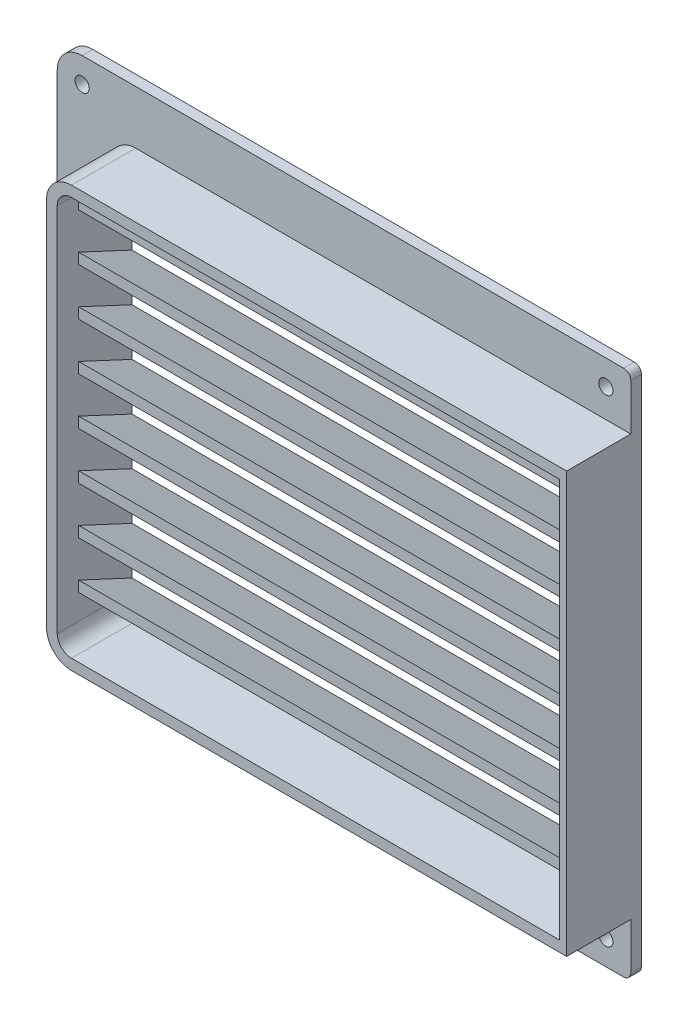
ISO-10303-21;
HEADER;
FILE_DESCRIPTION(('STEP AP214'),'2;1');
FILE_NAME('part.step','',(''),(''),'','','');
FILE_SCHEMA(('AUTOMOTIVE_DESIGN { 1 0 10303 214 1 1 1 1 }'));
ENDSEC;
DATA;
#1=APPLICATION_CONTEXT('core data for automotive mechanical design processes');
#2=APPLICATION_PROTOCOL_DEFINITION('international standard','automotive_design',2000,#1);
#3=PRODUCT_CONTEXT('',#1,'mechanical');
#4=PRODUCT('Part','Part','',(#3));
#5=PRODUCT_RELATED_PRODUCT_CATEGORY('part','',(#4));
#6=PRODUCT_DEFINITION_FORMATION('','',#4);
#7=PRODUCT_DEFINITION_CONTEXT('part definition',#1,'design');
#8=PRODUCT_DEFINITION('design','',#6,#7);
#9=PRODUCT_DEFINITION_SHAPE('','',#8);
#10=(LENGTH_UNIT() NAMED_UNIT(*) SI_UNIT(.MILLI.,.METRE.));
#11=(NAMED_UNIT(*) PLANE_ANGLE_UNIT() SI_UNIT($,.RADIAN.));
#12=(NAMED_UNIT(*) SI_UNIT($,.STERADIAN.) SOLID_ANGLE_UNIT());
#13=UNCERTAINTY_MEASURE_WITH_UNIT(LENGTH_MEASURE(1.E-05),#10,'distance_accuracy_value','');
#14=(GEOMETRIC_REPRESENTATION_CONTEXT(3) GLOBAL_UNCERTAINTY_ASSIGNED_CONTEXT((#13)) GLOBAL_UNIT_ASSIGNED_CONTEXT((#10,
#11,#12)) REPRESENTATION_CONTEXT('',''));
#15=CARTESIAN_POINT('',(0.,0.,0.));
#16=DIRECTION('',(0.,0.,1.));
#17=DIRECTION('',(1.,0.,0.));
#18=AXIS2_PLACEMENT_3D('',#15,#16,#17);
#19=CARTESIAN_POINT('',(0.,0.,0.));
#20=DIRECTION('',(1.,0.,0.));
#21=DIRECTION('',(0.,0.,-1.));
#22=AXIS2_PLACEMENT_3D('',#19,#20,#21);
#23=PLANE('',#22);
#24=DIRECTION('',(0.,1.,0.));
#25=VECTOR('',#24,1.);
#26=CARTESIAN_POINT('',(0.,118.,3.));
#27=LINE('',#26,#25);
#28=CARTESIAN_POINT('',(0.,7.00000000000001,3.));
#29=VERTEX_POINT('',#28);
#30=CARTESIAN_POINT('',(0.,111.,3.));
#31=VERTEX_POINT('',#30);
#32=EDGE_CURVE('E1048',#29,#31,#27,.T.);
#33=ORIENTED_EDGE('',*,*,#32,.F.);
#34=DIRECTION('',(0.,0.,-1.));
#35=VECTOR('',#34,1.);
#36=CARTESIAN_POINT('',(0.,7.,0.));
#37=LINE('',#36,#35);
#38=CARTESIAN_POINT('',(0.,7.,21.));
#39=VERTEX_POINT('',#38);
#40=EDGE_CURVE('E435',#29,#39,#37,.F.);
#41=ORIENTED_EDGE('',*,*,#40,.T.);
#42=DIRECTION('',(0.,-1.,0.));
#43=VECTOR('',#42,1.);
#44=CARTESIAN_POINT('',(0.,0.,21.));
#45=LINE('',#44,#43);
#46=CARTESIAN_POINT('',(0.,111.,21.));
#47=VERTEX_POINT('',#46);
#48=EDGE_CURVE('E404',#47,#39,#45,.T.);
#49=ORIENTED_EDGE('',*,*,#48,.F.);
#50=DIRECTION('',(0.,0.,1.));
#51=VECTOR('',#50,1.);
#52=CARTESIAN_POINT('',(0.,111.,3.));
#53=LINE('',#52,#51);
#54=EDGE_CURVE('E433',#47,#31,#53,.F.);
#55=ORIENTED_EDGE('',*,*,#54,.T.);
#56=EDGE_LOOP('',(#33,#41,#49,#55));
#57=FACE_BOUND('',#56,.T.);
#58=ADVANCED_FACE('F35',(#57),#23,.F.);
#59=CARTESIAN_POINT('',(146.,118.,139.038129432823));
#60=DIRECTION('',(0.,1.,0.));
#61=DIRECTION('',(0.,0.,1.));
#62=AXIS2_PLACEMENT_3D('',#59,#60,#61);
#63=PLANE('',#62);
#64=DIRECTION('',(-1.,0.,0.));
#65=VECTOR('',#64,1.);
#66=CARTESIAN_POINT('',(146.,118.,3.));
#67=LINE('',#66,#65);
#68=CARTESIAN_POINT('',(146.,118.,3.));
#69=VERTEX_POINT('',#68);
#70=CARTESIAN_POINT('',(7.00000000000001,118.,3.));
#71=VERTEX_POINT('',#70);
#72=EDGE_CURVE('E376',#69,#71,#67,.T.);
#73=ORIENTED_EDGE('',*,*,#72,.T.);
#74=DIRECTION('',(0.,0.,1.));
#75=VECTOR('',#74,1.);
#76=CARTESIAN_POINT('',(7.00000000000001,118.,21.));
#77=LINE('',#76,#75);
#78=CARTESIAN_POINT('',(7.00000000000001,118.,21.));
#79=VERTEX_POINT('',#78);
#80=EDGE_CURVE('E441',#71,#79,#77,.T.);
#81=ORIENTED_EDGE('',*,*,#80,.T.);
#82=DIRECTION('',(-1.,0.,0.));
#83=VECTOR('',#82,1.);
#84=CARTESIAN_POINT('',(146.,118.,21.));
#85=LINE('',#84,#83);
#86=CARTESIAN_POINT('',(146.,118.,21.));
#87=VERTEX_POINT('',#86);
#88=EDGE_CURVE('E390',#87,#79,#85,.T.);
#89=ORIENTED_EDGE('',*,*,#88,.F.);
#90=DIRECTION('',(0.,0.,-1.));
#91=VECTOR('',#90,1.);
#92=CARTESIAN_POINT('',(146.,118.,139.038129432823));
#93=LINE('',#92,#91);
#94=EDGE_CURVE('E366',#87,#69,#93,.T.);
#95=ORIENTED_EDGE('',*,*,#94,.T.);
#96=EDGE_LOOP('',(#73,#81,#89,#95));
#97=FACE_BOUND('',#96,.T.);
#98=ADVANCED_FACE('F388',(#97),#63,.T.);
#99=CARTESIAN_POINT('',(144.,118.,139.038129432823));
#100=DIRECTION('',(-1.,0.,0.));
#101=DIRECTION('',(0.,-1.,0.));
#102=AXIS2_PLACEMENT_3D('',#99,#100,#101);
#103=PLANE('',#102);
#104=DIRECTION('',(0.,-1.,0.));
#105=VECTOR('',#104,1.);
#106=CARTESIAN_POINT('',(144.,118.,15.0000000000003));
#107=LINE('',#106,#105);
#108=CARTESIAN_POINT('',(144.,109.994614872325,15.0000000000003));
#109=VERTEX_POINT('',#108);
#110=CARTESIAN_POINT('',(144.,106.994614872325,15.0000000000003));
#111=VERTEX_POINT('',#110);
#112=EDGE_CURVE('E614',#109,#111,#107,.T.);
#113=ORIENTED_EDGE('',*,*,#112,.T.);
#114=DIRECTION('',(0.,-0.422618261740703,-0.906307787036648));
#115=VECTOR('',#114,1.);
#116=CARTESIAN_POINT('',(144.,156.469604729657,121.099458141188));
#117=LINE('',#116,#115);
#118=CARTESIAN_POINT('',(144.,100.,3.28199245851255E-13));
#119=VERTEX_POINT('',#118);
#120=EDGE_CURVE('E620',#111,#119,#117,.T.);
#121=ORIENTED_EDGE('',*,*,#120,.T.);
#122=DIRECTION('',(0.,1.,0.));
#123=VECTOR('',#122,1.);
#124=CARTESIAN_POINT('',(144.,118.,0.));
#125=LINE('',#124,#123);
#126=CARTESIAN_POINT('',(144.,89.7142857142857,2.78320941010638E-13));
#127=VERTEX_POINT('',#126);
#128=EDGE_CURVE('E844',#127,#119,#125,.T.);
#129=ORIENTED_EDGE('',*,*,#128,.F.);
#130=DIRECTION('',(0.,0.422618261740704,0.906307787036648));
#131=VECTOR('',#130,1.);
#132=CARTESIAN_POINT('',(144.,148.020982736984,125.039115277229));
#133=LINE('',#132,#131);
#134=CARTESIAN_POINT('',(144.,96.7089005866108,15.0000000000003));
#135=VERTEX_POINT('',#134);
#136=EDGE_CURVE('E638',#127,#135,#133,.T.);
#137=ORIENTED_EDGE('',*,*,#136,.T.);
#138=DIRECTION('',(0.,-1.,0.));
#139=VECTOR('',#138,1.);
#140=CARTESIAN_POINT('',(144.,118.,15.0000000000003));
#141=LINE('',#140,#139);
#142=CARTESIAN_POINT('',(144.,93.7089005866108,15.0000000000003));
#143=VERTEX_POINT('',#142);
#144=EDGE_CURVE('E635',#135,#143,#141,.T.);
#145=ORIENTED_EDGE('',*,*,#144,.T.);
#146=DIRECTION('',(0.,-0.422618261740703,-0.906307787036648));
#147=VECTOR('',#146,1.);
#148=CARTESIAN_POINT('',(144.,145.556801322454,126.188181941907));
#149=LINE('',#148,#147);
#150=CARTESIAN_POINT('',(144.,86.7142857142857,2.78320941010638E-13));
#151=VERTEX_POINT('',#150);
#152=EDGE_CURVE('E641',#143,#151,#149,.T.);
#153=ORIENTED_EDGE('',*,*,#152,.T.);
#154=CARTESIAN_POINT('',(144.,76.4285714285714,2.31934117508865E-13));
#155=VERTEX_POINT('',#154);
#156=EDGE_CURVE('E846',#155,#151,#125,.T.);
#157=ORIENTED_EDGE('',*,*,#156,.F.);
#158=DIRECTION('',(0.,0.422618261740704,0.906307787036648));
#159=VECTOR('',#158,1.);
#160=CARTESIAN_POINT('',(144.,137.10817932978,130.127839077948));
#161=LINE('',#160,#159);
#162=CARTESIAN_POINT('',(144.,83.4231863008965,15.0000000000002));
#163=VERTEX_POINT('',#162);
#164=EDGE_CURVE('E743',#155,#163,#161,.T.);
#165=ORIENTED_EDGE('',*,*,#164,.T.);
#166=DIRECTION('',(0.,-1.,0.));
#167=VECTOR('',#166,1.);
#168=CARTESIAN_POINT('',(144.,118.,15.0000000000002));
#169=LINE('',#168,#167);
#170=CARTESIAN_POINT('',(144.,80.4231863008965,15.0000000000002));
#171=VERTEX_POINT('',#170);
#172=EDGE_CURVE('E740',#163,#171,#169,.T.);
#173=ORIENTED_EDGE('',*,*,#172,.T.);
#174=DIRECTION('',(0.,-0.422618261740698,-0.906307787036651));
#175=VECTOR('',#174,1.);
#176=CARTESIAN_POINT('',(144.,134.64399791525,131.276905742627));
#177=LINE('',#176,#175);
#178=CARTESIAN_POINT('',(144.,73.4285714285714,0.));
#179=VERTEX_POINT('',#178);
#180=EDGE_CURVE('E746',#171,#179,#177,.T.);
#181=ORIENTED_EDGE('',*,*,#180,.T.);
#182=CARTESIAN_POINT('',(144.,63.1428571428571,1.85547294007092E-13));
#183=VERTEX_POINT('',#182);
#184=EDGE_CURVE('E847',#183,#179,#125,.T.);
#185=ORIENTED_EDGE('',*,*,#184,.F.);
#186=DIRECTION('',(0.,0.422618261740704,0.906307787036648));
#187=VECTOR('',#186,1.);
#188=CARTESIAN_POINT('',(144.,126.195375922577,135.216562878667));
#189=LINE('',#188,#187);
#190=CARTESIAN_POINT('',(144.,70.1374720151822,15.0000000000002));
#191=VERTEX_POINT('',#190);
#192=EDGE_CURVE('E659',#183,#191,#189,.T.);
#193=ORIENTED_EDGE('',*,*,#192,.T.);
#194=DIRECTION('',(0.,-1.,0.));
#195=VECTOR('',#194,1.);
#196=CARTESIAN_POINT('',(144.,118.,15.0000000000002));
#197=LINE('',#196,#195);
#198=CARTESIAN_POINT('',(144.,67.1374720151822,15.0000000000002));
#199=VERTEX_POINT('',#198);
#200=EDGE_CURVE('E656',#191,#199,#197,.T.);
#201=ORIENTED_EDGE('',*,*,#200,.T.);
#202=DIRECTION('',(0.,-0.422618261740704,-0.906307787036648));
#203=VECTOR('',#202,1.);
#204=CARTESIAN_POINT('',(144.,123.731194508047,136.365629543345));
#205=LINE('',#204,#203);
#206=CARTESIAN_POINT('',(144.,60.1428571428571,1.85547294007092E-13));
#207=VERTEX_POINT('',#206);
#208=EDGE_CURVE('E662',#199,#207,#205,.T.);
#209=ORIENTED_EDGE('',*,*,#208,.T.);
#210=CARTESIAN_POINT('',(144.,49.8571428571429,1.39160470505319E-13));
#211=VERTEX_POINT('',#210);
#212=EDGE_CURVE('E850',#211,#207,#125,.T.);
#213=ORIENTED_EDGE('',*,*,#212,.F.);
#214=DIRECTION('',(0.,0.422618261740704,0.906307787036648));
#215=VECTOR('',#214,1.);
#216=CARTESIAN_POINT('',(144.,115.282572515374,140.305286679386));
#217=LINE('',#216,#215);
#218=CARTESIAN_POINT('',(144.,56.8517577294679,15.0000000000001));
#219=VERTEX_POINT('',#218);
#220=EDGE_CURVE('E680',#211,#219,#217,.T.);
#221=ORIENTED_EDGE('',*,*,#220,.T.);
#222=DIRECTION('',(0.,-1.,0.));
#223=VECTOR('',#222,1.);
#224=CARTESIAN_POINT('',(144.,118.,15.0000000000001));
#225=LINE('',#224,#223);
#226=CARTESIAN_POINT('',(144.,53.8517577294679,15.0000000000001));
#227=VERTEX_POINT('',#226);
#228=EDGE_CURVE('E677',#219,#227,#225,.T.);
#229=ORIENTED_EDGE('',*,*,#228,.T.);
#230=DIRECTION('',(0.,-0.422618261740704,-0.906307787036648));
#231=VECTOR('',#230,1.);
#232=CARTESIAN_POINT('',(144.,112.818391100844,141.454353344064));
#233=LINE('',#232,#231);
#234=CARTESIAN_POINT('',(144.,46.8571428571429,1.39160470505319E-13));
#235=VERTEX_POINT('',#234);
#236=EDGE_CURVE('E683',#227,#235,#233,.T.);
#237=ORIENTED_EDGE('',*,*,#236,.T.);
#238=CARTESIAN_POINT('',(144.,36.5714285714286,0.));
#239=VERTEX_POINT('',#238);
#240=EDGE_CURVE('E854',#239,#235,#125,.T.);
#241=ORIENTED_EDGE('',*,*,#240,.F.);
#242=DIRECTION('',(0.,0.422618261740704,0.906307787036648));
#243=VECTOR('',#242,1.);
#244=CARTESIAN_POINT('',(144.,104.36976910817,145.394010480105));
#245=LINE('',#244,#243);
#246=CARTESIAN_POINT('',(144.,43.5660434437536,15.0000000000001));
#247=VERTEX_POINT('',#246);
#248=EDGE_CURVE('E701',#239,#247,#245,.T.);
#249=ORIENTED_EDGE('',*,*,#248,.T.);
#250=DIRECTION('',(0.,-1.,0.));
#251=VECTOR('',#250,1.);
#252=CARTESIAN_POINT('',(144.,118.,15.0000000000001));
#253=LINE('',#252,#251);
#254=CARTESIAN_POINT('',(144.,40.5660434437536,15.0000000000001));
#255=VERTEX_POINT('',#254);
#256=EDGE_CURVE('E698',#247,#255,#253,.T.);
#257=ORIENTED_EDGE('',*,*,#256,.T.);
#258=DIRECTION('',(0.,-0.422618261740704,-0.906307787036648));
#259=VECTOR('',#258,1.);
#260=CARTESIAN_POINT('',(144.,101.90558769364,146.543077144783));
#261=LINE('',#260,#259);
#262=CARTESIAN_POINT('',(144.,33.5714285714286,0.));
#263=VERTEX_POINT('',#262);
#264=EDGE_CURVE('E704',#255,#263,#261,.T.);
#265=ORIENTED_EDGE('',*,*,#264,.T.);
#266=CARTESIAN_POINT('',(144.,23.2857142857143,0.));
#267=VERTEX_POINT('',#266);
#268=EDGE_CURVE('E849',#267,#263,#125,.T.);
#269=ORIENTED_EDGE('',*,*,#268,.F.);
#270=DIRECTION('',(0.,0.422618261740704,0.906307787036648));
#271=VECTOR('',#270,1.);
#272=CARTESIAN_POINT('',(144.,93.4569657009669,150.482734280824));
#273=LINE('',#272,#271);
#274=CARTESIAN_POINT('',(144.,30.2803291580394,15.));
#275=VERTEX_POINT('',#274);
#276=EDGE_CURVE('E722',#267,#275,#273,.T.);
#277=ORIENTED_EDGE('',*,*,#276,.T.);
#278=DIRECTION('',(0.,-1.,0.));
#279=VECTOR('',#278,1.);
#280=CARTESIAN_POINT('',(144.,118.,15.));
#281=LINE('',#280,#279);
#282=CARTESIAN_POINT('',(144.,27.2803291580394,15.));
#283=VERTEX_POINT('',#282);
#284=EDGE_CURVE('E719',#275,#283,#281,.T.);
#285=ORIENTED_EDGE('',*,*,#284,.T.);
#286=DIRECTION('',(0.,-0.422618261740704,-0.906307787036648));
#287=VECTOR('',#286,1.);
#288=CARTESIAN_POINT('',(144.,90.9927842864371,151.631800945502));
#289=LINE('',#288,#287);
#290=CARTESIAN_POINT('',(144.,20.2857142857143,0.));
#291=VERTEX_POINT('',#290);
#292=EDGE_CURVE('E725',#283,#291,#289,.T.);
#293=ORIENTED_EDGE('',*,*,#292,.T.);
#294=CARTESIAN_POINT('',(144.,10.,0.));
#295=VERTEX_POINT('',#294);
#296=EDGE_CURVE('E396',#295,#291,#125,.T.);
#297=ORIENTED_EDGE('',*,*,#296,.F.);
#298=DIRECTION('',(0.,0.422618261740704,0.906307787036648));
#299=VECTOR('',#298,1.);
#300=CARTESIAN_POINT('',(144.,82.5441622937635,155.571458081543));
#301=LINE('',#300,#299);
#302=CARTESIAN_POINT('',(144.,16.9946148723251,15.));
#303=VERTEX_POINT('',#302);
#304=EDGE_CURVE('E767',#295,#303,#301,.T.);
#305=ORIENTED_EDGE('',*,*,#304,.T.);
#306=DIRECTION('',(0.,-1.,0.));
#307=VECTOR('',#306,1.);
#308=CARTESIAN_POINT('',(144.,118.,14.9999999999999));
#309=LINE('',#308,#307);
#310=CARTESIAN_POINT('',(144.,13.9946148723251,15.));
#311=VERTEX_POINT('',#310);
#312=EDGE_CURVE('E764',#303,#311,#309,.T.);
#313=ORIENTED_EDGE('',*,*,#312,.T.);
#314=DIRECTION('',(0.,-0.422618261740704,-0.906307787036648));
#315=VECTOR('',#314,1.);
#316=CARTESIAN_POINT('',(144.,80.0799808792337,156.720524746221));
#317=LINE('',#316,#315);
#318=CARTESIAN_POINT('',(144.,7.00000000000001,0.));
#319=VERTEX_POINT('',#318);
#320=EDGE_CURVE('E761',#311,#319,#317,.T.);
#321=ORIENTED_EDGE('',*,*,#320,.T.);
#322=CARTESIAN_POINT('',(144.,3.,0.));
#323=VERTEX_POINT('',#322);
#324=EDGE_CURVE('E392',#323,#319,#125,.T.);
#325=ORIENTED_EDGE('',*,*,#324,.F.);
#326=DIRECTION('',(0.,0.,-1.));
#327=VECTOR('',#326,1.);
#328=CARTESIAN_POINT('',(144.,3.,0.));
#329=LINE('',#328,#327);
#330=CARTESIAN_POINT('',(144.,3.,21.));
#331=VERTEX_POINT('',#330);
#332=EDGE_CURVE('E401',#331,#323,#329,.T.);
#333=ORIENTED_EDGE('',*,*,#332,.F.);
#334=DIRECTION('',(0.,-1.,0.));
#335=VECTOR('',#334,1.);
#336=CARTESIAN_POINT('',(144.,118.,21.));
#337=LINE('',#336,#335);
#338=CARTESIAN_POINT('',(144.,115.,21.));
#339=VERTEX_POINT('',#338);
#340=EDGE_CURVE('E391',#339,#331,#337,.T.);
#341=ORIENTED_EDGE('',*,*,#340,.F.);
#342=DIRECTION('',(0.,0.,-1.));
#343=VECTOR('',#342,1.);
#344=CARTESIAN_POINT('',(144.,115.,139.038129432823));
#345=LINE('',#344,#343);
#346=CARTESIAN_POINT('',(144.,115.,0.));
#347=VERTEX_POINT('',#346);
#348=EDGE_CURVE('E423',#339,#347,#345,.T.);
#349=ORIENTED_EDGE('',*,*,#348,.T.);
#350=CARTESIAN_POINT('',(144.,103.,0.));
#351=VERTEX_POINT('',#350);
#352=EDGE_CURVE('E398',#351,#347,#125,.T.);
#353=ORIENTED_EDGE('',*,*,#352,.F.);
#354=DIRECTION('',(0.,0.422618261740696,0.906307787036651));
#355=VECTOR('',#354,1.);
#356=CARTESIAN_POINT('',(144.,158.933786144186,119.950391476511));
#357=LINE('',#356,#355);
#358=EDGE_CURVE('E617',#351,#109,#357,.T.);
#359=ORIENTED_EDGE('',*,*,#358,.T.);
#360=EDGE_LOOP('',(#113,#121,#129,#137,#145,#153,#157,#165,#173,#181,#185,#193,#201,#209,#213,
#221,#229,#237,#241,#249,#257,#265,#269,#277,#285,#293,#297,#305,#313,#321,#325,#333,#341,#349,
#353,#359));
#361=FACE_BOUND('',#360,.T.);
#362=ADVANCED_FACE('F843',(#361),#103,.T.);
#363=CARTESIAN_POINT('',(146.,0.,0.));
#364=DIRECTION('',(0.,0.,1.));
#365=DIRECTION('',(1.,0.,0.));
#366=AXIS2_PLACEMENT_3D('',#363,#364,#365);
#367=PLANE('',#366);
#368=DIRECTION('',(-1.,0.,0.));
#369=VECTOR('',#368,1.);
#370=CARTESIAN_POINT('',(146.,7.,0.));
#371=LINE('',#370,#369);
#372=CARTESIAN_POINT('',(2.99999999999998,7.00000000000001,0.));
#373=VERTEX_POINT('',#372);
#374=EDGE_CURVE('E749',#319,#373,#371,.T.);
#375=ORIENTED_EDGE('',*,*,#374,.T.);
#376=CARTESIAN_POINT('',(6.99999999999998,7.,0.));
#377=DIRECTION('',(0.,0.,1.));
#378=DIRECTION('',(1.,0.,0.));
#379=AXIS2_PLACEMENT_3D('',#376,#377,#378);
#380=CIRCLE('',#379,4.);
#381=CARTESIAN_POINT('',(6.99999999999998,3.,0.));
#382=VERTEX_POINT('',#381);
#383=EDGE_CURVE('E458',#373,#382,#380,.T.);
#384=ORIENTED_EDGE('',*,*,#383,.T.);
#385=DIRECTION('',(-1.,0.,0.));
#386=VECTOR('',#385,1.);
#387=CARTESIAN_POINT('',(146.,3.,0.));
#388=LINE('',#387,#386);
#389=EDGE_CURVE('E420',#323,#382,#388,.T.);
#390=ORIENTED_EDGE('',*,*,#389,.F.);
#391=ORIENTED_EDGE('',*,*,#324,.T.);
#392=EDGE_LOOP('',(#375,#384,#390,#391));
#393=FACE_BOUND('',#392,.T.);
#394=DIRECTION('',(0.,-1.,0.));
#395=VECTOR('',#394,1.);
#396=CARTESIAN_POINT('',(3.,118.,0.));
#397=LINE('',#396,#395);
#398=CARTESIAN_POINT('',(2.99999999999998,20.2857142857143,0.));
#399=VERTEX_POINT('',#398);
#400=CARTESIAN_POINT('',(2.99999999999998,9.99999999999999,0.));
#401=VERTEX_POINT('',#400);
#402=EDGE_CURVE('E533',#399,#401,#397,.T.);
#403=ORIENTED_EDGE('',*,*,#402,.T.);
#404=DIRECTION('',(-1.,0.,0.));
#405=VECTOR('',#404,1.);
#406=CARTESIAN_POINT('',(146.,10.,0.));
#407=LINE('',#406,#405);
#408=EDGE_CURVE('E758',#295,#401,#407,.T.);
#409=ORIENTED_EDGE('',*,*,#408,.F.);
#410=ORIENTED_EDGE('',*,*,#296,.T.);
#411=DIRECTION('',(-1.,0.,0.));
#412=VECTOR('',#411,1.);
#413=CARTESIAN_POINT('',(146.,20.2857142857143,0.));
#414=LINE('',#413,#412);
#415=EDGE_CURVE('E716',#291,#399,#414,.T.);
#416=ORIENTED_EDGE('',*,*,#415,.T.);
#417=EDGE_LOOP('',(#403,#409,#410,#416));
#418=FACE_BOUND('',#417,.T.);
#419=CARTESIAN_POINT('',(2.99999999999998,33.5714285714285,0.));
#420=VERTEX_POINT('',#419);
#421=CARTESIAN_POINT('',(2.99999999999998,23.2857142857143,0.));
#422=VERTEX_POINT('',#421);
#423=EDGE_CURVE('E810',#420,#422,#397,.T.);
#424=ORIENTED_EDGE('',*,*,#423,.T.);
#425=DIRECTION('',(-1.,0.,0.));
#426=VECTOR('',#425,1.);
#427=CARTESIAN_POINT('',(146.,23.2857142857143,0.));
#428=LINE('',#427,#426);
#429=EDGE_CURVE('E713',#267,#422,#428,.T.);
#430=ORIENTED_EDGE('',*,*,#429,.F.);
#431=ORIENTED_EDGE('',*,*,#268,.T.);
#432=DIRECTION('',(-1.,0.,0.));
#433=VECTOR('',#432,1.);
#434=CARTESIAN_POINT('',(146.,33.5714285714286,0.));
#435=LINE('',#434,#433);
#436=EDGE_CURVE('E695',#263,#420,#435,.T.);
#437=ORIENTED_EDGE('',*,*,#436,.T.);
#438=EDGE_LOOP('',(#424,#430,#431,#437));
#439=FACE_BOUND('',#438,.T.);
#440=CARTESIAN_POINT('',(2.99999999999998,46.8571428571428,0.));
#441=VERTEX_POINT('',#440);
#442=CARTESIAN_POINT('',(2.99999999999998,36.5714285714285,0.));
#443=VERTEX_POINT('',#442);
#444=EDGE_CURVE('E814',#441,#443,#397,.T.);
#445=ORIENTED_EDGE('',*,*,#444,.T.);
#446=DIRECTION('',(-1.,0.,0.));
#447=VECTOR('',#446,1.);
#448=CARTESIAN_POINT('',(146.,36.5714285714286,0.));
#449=LINE('',#448,#447);
#450=EDGE_CURVE('E692',#239,#443,#449,.T.);
#451=ORIENTED_EDGE('',*,*,#450,.F.);
#452=ORIENTED_EDGE('',*,*,#240,.T.);
#453=DIRECTION('',(-1.,0.,0.));
#454=VECTOR('',#453,1.);
#455=CARTESIAN_POINT('',(146.,46.8571428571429,1.39160470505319E-13));
#456=LINE('',#455,#454);
#457=EDGE_CURVE('E674',#235,#441,#456,.T.);
#458=ORIENTED_EDGE('',*,*,#457,.T.);
#459=EDGE_LOOP('',(#445,#451,#452,#458));
#460=FACE_BOUND('',#459,.T.);
#461=CARTESIAN_POINT('',(2.99999999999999,60.1428571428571,0.));
#462=VERTEX_POINT('',#461);
#463=CARTESIAN_POINT('',(2.99999999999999,49.8571428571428,0.));
#464=VERTEX_POINT('',#463);
#465=EDGE_CURVE('E818',#462,#464,#397,.T.);
#466=ORIENTED_EDGE('',*,*,#465,.T.);
#467=DIRECTION('',(-1.,0.,0.));
#468=VECTOR('',#467,1.);
#469=CARTESIAN_POINT('',(146.,49.8571428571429,1.39160470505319E-13));
#470=LINE('',#469,#468);
#471=EDGE_CURVE('E671',#211,#464,#470,.T.);
#472=ORIENTED_EDGE('',*,*,#471,.F.);
#473=ORIENTED_EDGE('',*,*,#212,.T.);
#474=DIRECTION('',(-1.,0.,0.));
#475=VECTOR('',#474,1.);
#476=CARTESIAN_POINT('',(146.,60.1428571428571,1.85547294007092E-13));
#477=LINE('',#476,#475);
#478=EDGE_CURVE('E653',#207,#462,#477,.T.);
#479=ORIENTED_EDGE('',*,*,#478,.T.);
#480=EDGE_LOOP('',(#466,#472,#473,#479));
#481=FACE_BOUND('',#480,.T.);
#482=CARTESIAN_POINT('',(2.99999999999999,73.4285714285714,0.));
#483=VERTEX_POINT('',#482);
#484=CARTESIAN_POINT('',(2.99999999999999,63.1428571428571,0.));
#485=VERTEX_POINT('',#484);
#486=EDGE_CURVE('E822',#483,#485,#397,.T.);
#487=ORIENTED_EDGE('',*,*,#486,.T.);
#488=DIRECTION('',(-1.,0.,0.));
#489=VECTOR('',#488,1.);
#490=CARTESIAN_POINT('',(146.,63.1428571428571,1.85547294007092E-13));
#491=LINE('',#490,#489);
#492=EDGE_CURVE('E650',#183,#485,#491,.T.);
#493=ORIENTED_EDGE('',*,*,#492,.F.);
#494=ORIENTED_EDGE('',*,*,#184,.T.);
#495=DIRECTION('',(-1.,0.,0.));
#496=VECTOR('',#495,1.);
#497=CARTESIAN_POINT('',(146.,73.4285714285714,0.));
#498=LINE('',#497,#496);
#499=EDGE_CURVE('E737',#179,#483,#498,.T.);
#500=ORIENTED_EDGE('',*,*,#499,.T.);
#501=EDGE_LOOP('',(#487,#493,#494,#500));
#502=FACE_BOUND('',#501,.T.);
#503=CARTESIAN_POINT('',(2.99999999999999,86.7142857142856,0.));
#504=VERTEX_POINT('',#503);
#505=CARTESIAN_POINT('',(2.99999999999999,76.4285714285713,0.));
#506=VERTEX_POINT('',#505);
#507=EDGE_CURVE('E826',#504,#506,#397,.T.);
#508=ORIENTED_EDGE('',*,*,#507,.T.);
#509=DIRECTION('',(-1.,0.,0.));
#510=VECTOR('',#509,1.);
#511=CARTESIAN_POINT('',(146.,76.4285714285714,2.31934117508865E-13));
#512=LINE('',#511,#510);
#513=EDGE_CURVE('E734',#155,#506,#512,.T.);
#514=ORIENTED_EDGE('',*,*,#513,.F.);
#515=ORIENTED_EDGE('',*,*,#156,.T.);
#516=DIRECTION('',(-1.,0.,0.));
#517=VECTOR('',#516,1.);
#518=CARTESIAN_POINT('',(146.,86.7142857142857,2.78320941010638E-13));
#519=LINE('',#518,#517);
#520=EDGE_CURVE('E632',#151,#504,#519,.T.);
#521=ORIENTED_EDGE('',*,*,#520,.T.);
#522=EDGE_LOOP('',(#508,#514,#515,#521));
#523=FACE_BOUND('',#522,.T.);
#524=CARTESIAN_POINT('',(3.,99.9999999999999,0.));
#525=VERTEX_POINT('',#524);
#526=CARTESIAN_POINT('',(2.99999999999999,89.7142857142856,0.));
#527=VERTEX_POINT('',#526);
#528=EDGE_CURVE('E532',#525,#527,#397,.T.);
#529=ORIENTED_EDGE('',*,*,#528,.T.);
#530=DIRECTION('',(-1.,0.,0.));
#531=VECTOR('',#530,1.);
#532=CARTESIAN_POINT('',(146.,89.7142857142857,2.78320941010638E-13));
#533=LINE('',#532,#531);
#534=EDGE_CURVE('E629',#127,#527,#533,.T.);
#535=ORIENTED_EDGE('',*,*,#534,.F.);
#536=ORIENTED_EDGE('',*,*,#128,.T.);
#537=DIRECTION('',(-1.,0.,0.));
#538=VECTOR('',#537,1.);
#539=CARTESIAN_POINT('',(146.,100.,3.28199245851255E-13));
#540=LINE('',#539,#538);
#541=EDGE_CURVE('E611',#119,#525,#540,.T.);
#542=ORIENTED_EDGE('',*,*,#541,.T.);
#543=EDGE_LOOP('',(#529,#535,#536,#542));
#544=FACE_BOUND('',#543,.T.);
#545=DIRECTION('',(-1.,0.,0.));
#546=VECTOR('',#545,1.);
#547=CARTESIAN_POINT('',(146.,115.,0.));
#548=LINE('',#547,#546);
#549=CARTESIAN_POINT('',(7.00000000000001,115.,0.));
#550=VERTEX_POINT('',#549);
#551=EDGE_CURVE('E770',#347,#550,#548,.T.);
#552=ORIENTED_EDGE('',*,*,#551,.T.);
#553=CARTESIAN_POINT('',(7.00000000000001,111.,0.));
#554=DIRECTION('',(0.,0.,1.));
#555=DIRECTION('',(1.,0.,0.));
#556=AXIS2_PLACEMENT_3D('',#553,#554,#555);
#557=CIRCLE('',#556,4.);
#558=CARTESIAN_POINT('',(3.,111.,0.));
#559=VERTEX_POINT('',#558);
#560=EDGE_CURVE('E460',#550,#559,#557,.T.);
#561=ORIENTED_EDGE('',*,*,#560,.T.);
#562=CARTESIAN_POINT('',(3.,103.,0.));
#563=VERTEX_POINT('',#562);
#564=EDGE_CURVE('E530',#559,#563,#397,.T.);
#565=ORIENTED_EDGE('',*,*,#564,.T.);
#566=DIRECTION('',(-1.,0.,0.));
#567=VECTOR('',#566,1.);
#568=CARTESIAN_POINT('',(146.,103.,0.));
#569=LINE('',#568,#567);
#570=EDGE_CURVE('E608',#351,#563,#569,.T.);
#571=ORIENTED_EDGE('',*,*,#570,.F.);
#572=ORIENTED_EDGE('',*,*,#352,.T.);
#573=EDGE_LOOP('',(#552,#561,#565,#571,#572));
#574=FACE_BOUND('',#573,.T.);
#575=DIRECTION('',(-1.,0.,0.));
#576=VECTOR('',#575,1.);
#577=CARTESIAN_POINT('',(146.,-15.,0.));
#578=LINE('',#577,#576);
#579=CARTESIAN_POINT('',(144.,-15.,0.));
#580=VERTEX_POINT('',#579);
#581=CARTESIAN_POINT('',(-7.99999999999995,-15.,0.));
#582=VERTEX_POINT('',#581);
#583=EDGE_CURVE('E516',#580,#582,#578,.T.);
#584=ORIENTED_EDGE('',*,*,#583,.T.);
#585=CARTESIAN_POINT('',(-8.00000000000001,-8.,0.));
#586=DIRECTION('',(0.,0.,1.));
#587=DIRECTION('',(1.,0.,0.));
#588=AXIS2_PLACEMENT_3D('',#585,#586,#587);
#589=CIRCLE('',#588,7.);
#590=CARTESIAN_POINT('',(-15.,-8.,0.));
#591=VERTEX_POINT('',#590);
#592=EDGE_CURVE('E486',#582,#591,#589,.F.);
#593=ORIENTED_EDGE('',*,*,#592,.T.);
#594=DIRECTION('',(0.,1.,0.));
#595=VECTOR('',#594,1.);
#596=CARTESIAN_POINT('',(-15.,0.,0.));
#597=LINE('',#596,#595);
#598=CARTESIAN_POINT('',(-15.,126.,0.));
#599=VERTEX_POINT('',#598);
#600=EDGE_CURVE('E515',#591,#599,#597,.T.);
#601=ORIENTED_EDGE('',*,*,#600,.T.);
#602=CARTESIAN_POINT('',(-8.,126.,0.));
#603=DIRECTION('',(0.,0.,1.));
#604=DIRECTION('',(1.,0.,0.));
#605=AXIS2_PLACEMENT_3D('',#602,#603,#604);
#606=CIRCLE('',#605,7.);
#607=CARTESIAN_POINT('',(-7.99999999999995,133.,0.));
#608=VERTEX_POINT('',#607);
#609=EDGE_CURVE('E484',#599,#608,#606,.F.);
#610=ORIENTED_EDGE('',*,*,#609,.T.);
#611=DIRECTION('',(1.,0.,0.));
#612=VECTOR('',#611,1.);
#613=CARTESIAN_POINT('',(146.,133.,0.));
#614=LINE('',#613,#612);
#615=CARTESIAN_POINT('',(144.,133.,0.));
#616=VERTEX_POINT('',#615);
#617=EDGE_CURVE('E385',#608,#616,#614,.T.);
#618=ORIENTED_EDGE('',*,*,#617,.T.);
#619=CARTESIAN_POINT('',(144.,131.,0.));
#620=DIRECTION('',(0.,0.,1.));
#621=DIRECTION('',(1.,0.,0.));
#622=AXIS2_PLACEMENT_3D('',#619,#620,#621);
#623=CIRCLE('',#622,2.);
#624=CARTESIAN_POINT('',(146.,131.,0.));
#625=VERTEX_POINT('',#624);
#626=EDGE_CURVE('E468',#616,#625,#623,.F.);
#627=ORIENTED_EDGE('',*,*,#626,.T.);
#628=DIRECTION('',(0.,1.,0.));
#629=VECTOR('',#628,1.);
#630=CARTESIAN_POINT('',(146.,0.,0.));
#631=LINE('',#630,#629);
#632=CARTESIAN_POINT('',(146.,-13.,0.));
#633=VERTEX_POINT('',#632);
#634=EDGE_CURVE('E405',#633,#625,#631,.T.);
#635=ORIENTED_EDGE('',*,*,#634,.F.);
#636=CARTESIAN_POINT('',(144.,-13.,0.));
#637=DIRECTION('',(0.,0.,1.));
#638=DIRECTION('',(1.,0.,0.));
#639=AXIS2_PLACEMENT_3D('',#636,#637,#638);
#640=CIRCLE('',#639,2.);
#641=EDGE_CURVE('E470',#633,#580,#640,.F.);
#642=ORIENTED_EDGE('',*,*,#641,.T.);
#643=EDGE_LOOP('',(#584,#593,#601,#610,#618,#627,#635,#642));
#644=FACE_BOUND('',#643,.T.);
#645=CARTESIAN_POINT('',(-7.99999999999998,-8.,0.));
#646=DIRECTION('',(0.,0.,-1.));
#647=DIRECTION('',(1.,0.,0.));
#648=AXIS2_PLACEMENT_3D('',#645,#646,#647);
#649=CIRCLE('',#648,2.);
#650=CARTESIAN_POINT('',(-5.99999999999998,-8.,0.));
#651=VERTEX_POINT('',#650);
#652=EDGE_CURVE('E372',#651,#651,#649,.T.);
#653=ORIENTED_EDGE('',*,*,#652,.F.);
#654=EDGE_LOOP('',(#653));
#655=FACE_BOUND('',#654,.T.);
#656=CARTESIAN_POINT('',(139.,-8.,0.));
#657=DIRECTION('',(0.,0.,-1.));
#658=DIRECTION('',(-1.,0.,0.));
#659=AXIS2_PLACEMENT_3D('',#656,#657,#658);
#660=CIRCLE('',#659,2.);
#661=CARTESIAN_POINT('',(137.,-8.,0.));
#662=VERTEX_POINT('',#661);
#663=EDGE_CURVE('E802',#662,#662,#660,.T.);
#664=ORIENTED_EDGE('',*,*,#663,.F.);
#665=EDGE_LOOP('',(#664));
#666=FACE_BOUND('',#665,.T.);
#667=CARTESIAN_POINT('',(139.,126.,0.));
#668=DIRECTION('',(0.,0.,-1.));
#669=DIRECTION('',(1.,0.,0.));
#670=AXIS2_PLACEMENT_3D('',#667,#668,#669);
#671=CIRCLE('',#670,2.);
#672=CARTESIAN_POINT('',(141.,126.,0.));
#673=VERTEX_POINT('',#672);
#674=EDGE_CURVE('E1046',#673,#673,#671,.T.);
#675=ORIENTED_EDGE('',*,*,#674,.F.);
#676=EDGE_LOOP('',(#675));
#677=FACE_BOUND('',#676,.T.);
#678=CARTESIAN_POINT('',(-7.99999999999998,126.,0.));
#679=DIRECTION('',(0.,0.,-1.));
#680=DIRECTION('',(-1.,0.,0.));
#681=AXIS2_PLACEMENT_3D('',#678,#679,#680);
#682=CIRCLE('',#681,2.);
#683=CARTESIAN_POINT('',(-9.99999999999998,126.,0.));
#684=VERTEX_POINT('',#683);
#685=EDGE_CURVE('E1050',#684,#684,#682,.T.);
#686=ORIENTED_EDGE('',*,*,#685,.F.);
#687=EDGE_LOOP('',(#686));
#688=FACE_BOUND('',#687,.T.);
#689=ADVANCED_FACE('F513',(#393,#418,#439,#460,#481,#502,#523,#544,#574,#644,#655,#666,#677,
#688),#367,.F.);
#690=CARTESIAN_POINT('',(146.,3.,0.));
#691=DIRECTION('',(0.,-1.,0.));
#692=DIRECTION('',(0.,0.,-1.));
#693=AXIS2_PLACEMENT_3D('',#690,#691,#692);
#694=PLANE('',#693);
#695=ORIENTED_EDGE('',*,*,#389,.T.);
#696=DIRECTION('',(0.,0.,1.));
#697=VECTOR('',#696,1.);
#698=CARTESIAN_POINT('',(6.99999999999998,3.,0.));
#699=LINE('',#698,#697);
#700=CARTESIAN_POINT('',(6.99999999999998,3.,21.));
#701=VERTEX_POINT('',#700);
#702=EDGE_CURVE('E446',#382,#701,#699,.T.);
#703=ORIENTED_EDGE('',*,*,#702,.T.);
#704=DIRECTION('',(-1.,0.,0.));
#705=VECTOR('',#704,1.);
#706=CARTESIAN_POINT('',(146.,3.,21.));
#707=LINE('',#706,#705);
#708=EDGE_CURVE('E417',#331,#701,#707,.T.);
#709=ORIENTED_EDGE('',*,*,#708,.F.);
#710=ORIENTED_EDGE('',*,*,#332,.T.);
#711=EDGE_LOOP('',(#695,#703,#709,#710));
#712=FACE_BOUND('',#711,.T.);
#713=ADVANCED_FACE('F876',(#712),#694,.F.);
#714=CARTESIAN_POINT('',(146.,0.,21.));
#715=DIRECTION('',(0.,0.,-1.));
#716=DIRECTION('',(-1.,0.,0.));
#717=AXIS2_PLACEMENT_3D('',#714,#715,#716);
#718=PLANE('',#717);
#719=ORIENTED_EDGE('',*,*,#708,.T.);
#720=CARTESIAN_POINT('',(6.99999999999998,7.,21.));
#721=DIRECTION('',(0.,0.,-1.));
#722=DIRECTION('',(-1.,0.,0.));
#723=AXIS2_PLACEMENT_3D('',#720,#721,#722);
#724=CIRCLE('',#723,4.);
#725=CARTESIAN_POINT('',(2.99999999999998,7.00000000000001,21.));
#726=VERTEX_POINT('',#725);
#727=EDGE_CURVE('E456',#701,#726,#724,.T.);
#728=ORIENTED_EDGE('',*,*,#727,.T.);
#729=DIRECTION('',(0.,1.,0.));
#730=VECTOR('',#729,1.);
#731=CARTESIAN_POINT('',(3.,118.,21.));
#732=LINE('',#731,#730);
#733=CARTESIAN_POINT('',(3.,111.,21.));
#734=VERTEX_POINT('',#733);
#735=EDGE_CURVE('E526',#726,#734,#732,.T.);
#736=ORIENTED_EDGE('',*,*,#735,.T.);
#737=CARTESIAN_POINT('',(7.00000000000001,111.,21.));
#738=DIRECTION('',(0.,0.,-1.));
#739=DIRECTION('',(-1.,0.,0.));
#740=AXIS2_PLACEMENT_3D('',#737,#738,#739);
#741=CIRCLE('',#740,4.);
#742=CARTESIAN_POINT('',(7.00000000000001,115.,21.));
#743=VERTEX_POINT('',#742);
#744=EDGE_CURVE('E462',#734,#743,#741,.T.);
#745=ORIENTED_EDGE('',*,*,#744,.T.);
#746=DIRECTION('',(-1.,0.,0.));
#747=VECTOR('',#746,1.);
#748=CARTESIAN_POINT('',(146.,115.,21.));
#749=LINE('',#748,#747);
#750=EDGE_CURVE('E773',#339,#743,#749,.T.);
#751=ORIENTED_EDGE('',*,*,#750,.F.);
#752=ORIENTED_EDGE('',*,*,#340,.T.);
#753=EDGE_LOOP('',(#719,#728,#736,#745,#751,#752));
#754=FACE_BOUND('',#753,.T.);
#755=ORIENTED_EDGE('',*,*,#48,.T.);
#756=CARTESIAN_POINT('',(7.00000000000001,7.,21.));
#757=DIRECTION('',(0.,0.,-1.));
#758=DIRECTION('',(-1.,0.,0.));
#759=AXIS2_PLACEMENT_3D('',#756,#757,#758);
#760=CIRCLE('',#759,7.);
#761=CARTESIAN_POINT('',(7.00000000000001,0.,21.));
#762=VERTEX_POINT('',#761);
#763=EDGE_CURVE('E439',#39,#762,#760,.F.);
#764=ORIENTED_EDGE('',*,*,#763,.T.);
#765=DIRECTION('',(-1.,0.,0.));
#766=VECTOR('',#765,1.);
#767=CARTESIAN_POINT('',(146.,0.,21.));
#768=LINE('',#767,#766);
#769=CARTESIAN_POINT('',(146.,0.,21.));
#770=VERTEX_POINT('',#769);
#771=EDGE_CURVE('E412',#770,#762,#768,.T.);
#772=ORIENTED_EDGE('',*,*,#771,.F.);
#773=DIRECTION('',(0.,-1.,0.));
#774=VECTOR('',#773,1.);
#775=CARTESIAN_POINT('',(146.,0.,21.));
#776=LINE('',#775,#774);
#777=EDGE_CURVE('E407',#87,#770,#776,.T.);
#778=ORIENTED_EDGE('',*,*,#777,.F.);
#779=ORIENTED_EDGE('',*,*,#88,.T.);
#780=CARTESIAN_POINT('',(7.00000000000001,111.,21.));
#781=DIRECTION('',(0.,0.,-1.));
#782=DIRECTION('',(-1.,0.,0.));
#783=AXIS2_PLACEMENT_3D('',#780,#781,#782);
#784=CIRCLE('',#783,7.);
#785=EDGE_CURVE('E437',#79,#47,#784,.F.);
#786=ORIENTED_EDGE('',*,*,#785,.T.);
#787=EDGE_LOOP('',(#755,#764,#772,#778,#779,#786));
#788=FACE_BOUND('',#787,.T.);
#789=ADVANCED_FACE('F776',(#754,#788),#718,.F.);
#790=CARTESIAN_POINT('',(146.,0.,0.));
#791=DIRECTION('',(0.,1.,0.));
#792=DIRECTION('',(0.,0.,1.));
#793=AXIS2_PLACEMENT_3D('',#790,#791,#792);
#794=PLANE('',#793);
#795=ORIENTED_EDGE('',*,*,#771,.T.);
#796=DIRECTION('',(0.,0.,-1.));
#797=VECTOR('',#796,1.);
#798=CARTESIAN_POINT('',(7.00000000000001,0.,0.));
#799=LINE('',#798,#797);
#800=CARTESIAN_POINT('',(7.00000000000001,0.,3.));
#801=VERTEX_POINT('',#800);
#802=EDGE_CURVE('E430',#762,#801,#799,.T.);
#803=ORIENTED_EDGE('',*,*,#802,.T.);
#804=DIRECTION('',(1.,0.,0.));
#805=VECTOR('',#804,1.);
#806=CARTESIAN_POINT('',(146.,0.,3.));
#807=LINE('',#806,#805);
#808=CARTESIAN_POINT('',(146.,0.,3.));
#809=VERTEX_POINT('',#808);
#810=EDGE_CURVE('E429',#801,#809,#807,.T.);
#811=ORIENTED_EDGE('',*,*,#810,.T.);
#812=DIRECTION('',(0.,0.,-1.));
#813=VECTOR('',#812,1.);
#814=CARTESIAN_POINT('',(146.,0.,0.));
#815=LINE('',#814,#813);
#816=EDGE_CURVE('E409',#770,#809,#815,.T.);
#817=ORIENTED_EDGE('',*,*,#816,.F.);
#818=EDGE_LOOP('',(#795,#803,#811,#817));
#819=FACE_BOUND('',#818,.T.);
#820=ADVANCED_FACE('F783',(#819),#794,.F.);
#821=CARTESIAN_POINT('',(146.,0.,0.));
#822=DIRECTION('',(1.,0.,0.));
#823=DIRECTION('',(0.,0.,-1.));
#824=AXIS2_PLACEMENT_3D('',#821,#822,#823);
#825=PLANE('',#824);
#826=DIRECTION('',(0.,-1.,0.));
#827=VECTOR('',#826,1.);
#828=CARTESIAN_POINT('',(146.,0.,3.));
#829=LINE('',#828,#827);
#830=CARTESIAN_POINT('',(146.,-13.,3.));
#831=VERTEX_POINT('',#830);
#832=EDGE_CURVE('E507',#809,#831,#829,.T.);
#833=ORIENTED_EDGE('',*,*,#832,.T.);
#834=DIRECTION('',(0.,0.,-1.));
#835=VECTOR('',#834,1.);
#836=CARTESIAN_POINT('',(146.,-13.,0.));
#837=LINE('',#836,#835);
#838=EDGE_CURVE('E465',#831,#633,#837,.T.);
#839=ORIENTED_EDGE('',*,*,#838,.T.);
#840=ORIENTED_EDGE('',*,*,#634,.T.);
#841=DIRECTION('',(0.,0.,-1.));
#842=VECTOR('',#841,1.);
#843=CARTESIAN_POINT('',(146.,131.,0.));
#844=LINE('',#843,#842);
#845=CARTESIAN_POINT('',(146.,131.,3.));
#846=VERTEX_POINT('',#845);
#847=EDGE_CURVE('E369',#625,#846,#844,.F.);
#848=ORIENTED_EDGE('',*,*,#847,.T.);
#849=DIRECTION('',(0.,-1.,0.));
#850=VECTOR('',#849,1.);
#851=CARTESIAN_POINT('',(146.,118.,3.));
#852=LINE('',#851,#850);
#853=EDGE_CURVE('E361',#846,#69,#852,.T.);
#854=ORIENTED_EDGE('',*,*,#853,.T.);
#855=ORIENTED_EDGE('',*,*,#94,.F.);
#856=ORIENTED_EDGE('',*,*,#777,.T.);
#857=ORIENTED_EDGE('',*,*,#816,.T.);
#858=EDGE_LOOP('',(#833,#839,#840,#848,#854,#855,#856,#857));
#859=FACE_BOUND('',#858,.T.);
#860=ADVANCED_FACE('F364',(#859),#825,.T.);
#861=CARTESIAN_POINT('',(146.,115.,0.));
#862=DIRECTION('',(0.,1.,0.));
#863=DIRECTION('',(0.,0.,1.));
#864=AXIS2_PLACEMENT_3D('',#861,#862,#863);
#865=PLANE('',#864);
#866=ORIENTED_EDGE('',*,*,#750,.T.);
#867=DIRECTION('',(0.,0.,-1.));
#868=VECTOR('',#867,1.);
#869=CARTESIAN_POINT('',(7.00000000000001,115.,0.));
#870=LINE('',#869,#868);
#871=EDGE_CURVE('E453',#743,#550,#870,.T.);
#872=ORIENTED_EDGE('',*,*,#871,.T.);
#873=ORIENTED_EDGE('',*,*,#551,.F.);
#874=ORIENTED_EDGE('',*,*,#348,.F.);
#875=EDGE_LOOP('',(#866,#872,#873,#874));
#876=FACE_BOUND('',#875,.T.);
#877=ADVANCED_FACE('F922',(#876),#865,.F.);
#878=CARTESIAN_POINT('',(146.,16.9946148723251,15.));
#879=DIRECTION('',(0.,-0.906307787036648,0.422618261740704));
#880=DIRECTION('',(0.,-0.422618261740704,-0.906307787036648));
#881=AXIS2_PLACEMENT_3D('',#878,#879,#880);
#882=PLANE('',#881);
#883=ORIENTED_EDGE('',*,*,#408,.T.);
#884=DIRECTION('',(0.,0.422618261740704,0.906307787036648));
#885=VECTOR('',#884,1.);
#886=CARTESIAN_POINT('',(2.99999999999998,16.9946148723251,15.));
#887=LINE('',#886,#885);
#888=CARTESIAN_POINT('',(2.99999999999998,16.9946148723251,15.));
#889=VERTEX_POINT('',#888);
#890=EDGE_CURVE('E599',#401,#889,#887,.T.);
#891=ORIENTED_EDGE('',*,*,#890,.T.);
#892=DIRECTION('',(-1.,0.,0.));
#893=VECTOR('',#892,1.);
#894=CARTESIAN_POINT('',(146.,16.9946148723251,15.));
#895=LINE('',#894,#893);
#896=EDGE_CURVE('E755',#303,#889,#895,.T.);
#897=ORIENTED_EDGE('',*,*,#896,.F.);
#898=ORIENTED_EDGE('',*,*,#304,.F.);
#899=EDGE_LOOP('',(#883,#891,#897,#898));
#900=FACE_BOUND('',#899,.T.);
#901=ADVANCED_FACE('F920',(#900),#882,.F.);
#902=CARTESIAN_POINT('',(146.,13.9946148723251,15.));
#903=DIRECTION('',(0.,0.,-1.));
#904=DIRECTION('',(0.,1.,0.));
#905=AXIS2_PLACEMENT_3D('',#902,#903,#904);
#906=PLANE('',#905);
#907=ORIENTED_EDGE('',*,*,#896,.T.);
#908=DIRECTION('',(0.,-1.,0.));
#909=VECTOR('',#908,1.);
#910=CARTESIAN_POINT('',(2.99999999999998,13.9946148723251,15.));
#911=LINE('',#910,#909);
#912=CARTESIAN_POINT('',(2.99999999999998,13.9946148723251,15.));
#913=VERTEX_POINT('',#912);
#914=EDGE_CURVE('E596',#889,#913,#911,.T.);
#915=ORIENTED_EDGE('',*,*,#914,.T.);
#916=DIRECTION('',(-1.,0.,0.));
#917=VECTOR('',#916,1.);
#918=CARTESIAN_POINT('',(146.,13.9946148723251,15.));
#919=LINE('',#918,#917);
#920=EDGE_CURVE('E752',#311,#913,#919,.T.);
#921=ORIENTED_EDGE('',*,*,#920,.F.);
#922=ORIENTED_EDGE('',*,*,#312,.F.);
#923=EDGE_LOOP('',(#907,#915,#921,#922));
#924=FACE_BOUND('',#923,.T.);
#925=ADVANCED_FACE('F917',(#924),#906,.F.);
#926=CARTESIAN_POINT('',(146.,7.,0.));
#927=DIRECTION('',(0.,0.906307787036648,-0.422618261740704));
#928=DIRECTION('',(0.,0.422618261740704,0.906307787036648));
#929=AXIS2_PLACEMENT_3D('',#926,#927,#928);
#930=PLANE('',#929);
#931=ORIENTED_EDGE('',*,*,#920,.T.);
#932=DIRECTION('',(0.,-0.422618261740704,-0.906307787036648));
#933=VECTOR('',#932,1.);
#934=CARTESIAN_POINT('',(2.99999999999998,7.00000000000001,0.));
#935=LINE('',#934,#933);
#936=EDGE_CURVE('E593',#913,#373,#935,.T.);
#937=ORIENTED_EDGE('',*,*,#936,.T.);
#938=ORIENTED_EDGE('',*,*,#374,.F.);
#939=ORIENTED_EDGE('',*,*,#320,.F.);
#940=EDGE_LOOP('',(#931,#937,#938,#939));
#941=FACE_BOUND('',#940,.T.);
#942=ADVANCED_FACE('F914',(#941),#930,.F.);
#943=CARTESIAN_POINT('',(146.,73.4285714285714,0.));
#944=DIRECTION('',(0.,0.90630778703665,-0.422618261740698));
#945=DIRECTION('',(0.,0.422618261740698,0.906307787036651));
#946=AXIS2_PLACEMENT_3D('',#943,#944,#945);
#947=PLANE('',#946);
#948=DIRECTION('',(-1.,0.,0.));
#949=VECTOR('',#948,1.);
#950=CARTESIAN_POINT('',(146.,80.4231863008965,15.0000000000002));
#951=LINE('',#950,#949);
#952=CARTESIAN_POINT('',(3.,80.4231863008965,15.0000000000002));
#953=VERTEX_POINT('',#952);
#954=EDGE_CURVE('E728',#171,#953,#951,.T.);
#955=ORIENTED_EDGE('',*,*,#954,.T.);
#956=DIRECTION('',(0.,-0.422618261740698,-0.906307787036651));
#957=VECTOR('',#956,1.);
#958=CARTESIAN_POINT('',(3.,73.4285714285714,0.));
#959=LINE('',#958,#957);
#960=EDGE_CURVE('E590',#953,#483,#959,.T.);
#961=ORIENTED_EDGE('',*,*,#960,.T.);
#962=ORIENTED_EDGE('',*,*,#499,.F.);
#963=ORIENTED_EDGE('',*,*,#180,.F.);
#964=EDGE_LOOP('',(#955,#961,#962,#963));
#965=FACE_BOUND('',#964,.T.);
#966=ADVANCED_FACE('F934',(#965),#947,.F.);
#967=CARTESIAN_POINT('',(146.,83.4231863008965,15.0000000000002));
#968=DIRECTION('',(0.,-0.906307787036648,0.422618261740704));
#969=DIRECTION('',(0.,-0.422618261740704,-0.906307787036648));
#970=AXIS2_PLACEMENT_3D('',#967,#968,#969);
#971=PLANE('',#970);
#972=ORIENTED_EDGE('',*,*,#513,.T.);
#973=DIRECTION('',(0.,0.422618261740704,0.906307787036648));
#974=VECTOR('',#973,1.);
#975=CARTESIAN_POINT('',(3.,83.4231863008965,15.0000000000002));
#976=LINE('',#975,#974);
#977=CARTESIAN_POINT('',(3.,83.4231863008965,15.0000000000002));
#978=VERTEX_POINT('',#977);
#979=EDGE_CURVE('E587',#506,#978,#976,.T.);
#980=ORIENTED_EDGE('',*,*,#979,.T.);
#981=DIRECTION('',(-1.,0.,0.));
#982=VECTOR('',#981,1.);
#983=CARTESIAN_POINT('',(146.,83.4231863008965,15.0000000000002));
#984=LINE('',#983,#982);
#985=EDGE_CURVE('E731',#163,#978,#984,.T.);
#986=ORIENTED_EDGE('',*,*,#985,.F.);
#987=ORIENTED_EDGE('',*,*,#164,.F.);
#988=EDGE_LOOP('',(#972,#980,#986,#987));
#989=FACE_BOUND('',#988,.T.);
#990=ADVANCED_FACE('F937',(#989),#971,.F.);
#991=CARTESIAN_POINT('',(146.,80.4231863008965,15.0000000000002));
#992=DIRECTION('',(0.,0.,-1.));
#993=DIRECTION('',(0.,1.,0.));
#994=AXIS2_PLACEMENT_3D('',#991,#992,#993);
#995=PLANE('',#994);
#996=ORIENTED_EDGE('',*,*,#985,.T.);
#997=DIRECTION('',(0.,-1.,0.));
#998=VECTOR('',#997,1.);
#999=CARTESIAN_POINT('',(3.,80.4231863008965,15.0000000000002));
#1000=LINE('',#999,#998);
#1001=EDGE_CURVE('E584',#978,#953,#1000,.T.);
#1002=ORIENTED_EDGE('',*,*,#1001,.T.);
#1003=ORIENTED_EDGE('',*,*,#954,.F.);
#1004=ORIENTED_EDGE('',*,*,#172,.F.);
#1005=EDGE_LOOP('',(#996,#1002,#1003,#1004));
#1006=FACE_BOUND('',#1005,.T.);
#1007=ADVANCED_FACE('F941',(#1006),#995,.F.);
#1008=CARTESIAN_POINT('',(146.,20.2857142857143,0.));
#1009=DIRECTION('',(0.,0.906307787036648,-0.422618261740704));
#1010=DIRECTION('',(0.,0.422618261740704,0.906307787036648));
#1011=AXIS2_PLACEMENT_3D('',#1008,#1009,#1010);
#1012=PLANE('',#1011);
#1013=DIRECTION('',(-1.,0.,0.));
#1014=VECTOR('',#1013,1.);
#1015=CARTESIAN_POINT('',(146.,27.2803291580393,15.));
#1016=LINE('',#1015,#1014);
#1017=CARTESIAN_POINT('',(2.99999999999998,27.2803291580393,15.));
#1018=VERTEX_POINT('',#1017);
#1019=EDGE_CURVE('E707',#283,#1018,#1016,.T.);
#1020=ORIENTED_EDGE('',*,*,#1019,.T.);
#1021=DIRECTION('',(0.,-0.422618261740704,-0.906307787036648));
#1022=VECTOR('',#1021,1.);
#1023=CARTESIAN_POINT('',(2.99999999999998,20.2857142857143,0.));
#1024=LINE('',#1023,#1022);
#1025=EDGE_CURVE('E581',#1018,#399,#1024,.T.);
#1026=ORIENTED_EDGE('',*,*,#1025,.T.);
#1027=ORIENTED_EDGE('',*,*,#415,.F.);
#1028=ORIENTED_EDGE('',*,*,#292,.F.);
#1029=EDGE_LOOP('',(#1020,#1026,#1027,#1028));
#1030=FACE_BOUND('',#1029,.T.);
#1031=ADVANCED_FACE('F864',(#1030),#1012,.F.);
#1032=CARTESIAN_POINT('',(146.,30.2803291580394,15.));
#1033=DIRECTION('',(0.,-0.906307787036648,0.422618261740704));
#1034=DIRECTION('',(0.,-0.422618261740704,-0.906307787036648));
#1035=AXIS2_PLACEMENT_3D('',#1032,#1033,#1034);
#1036=PLANE('',#1035);
#1037=ORIENTED_EDGE('',*,*,#429,.T.);
#1038=DIRECTION('',(0.,0.422618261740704,0.906307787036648));
#1039=VECTOR('',#1038,1.);
#1040=CARTESIAN_POINT('',(2.99999999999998,30.2803291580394,15.0000000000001));
#1041=LINE('',#1040,#1039);
#1042=CARTESIAN_POINT('',(2.99999999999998,30.2803291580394,15.));
#1043=VERTEX_POINT('',#1042);
#1044=EDGE_CURVE('E578',#422,#1043,#1041,.T.);
#1045=ORIENTED_EDGE('',*,*,#1044,.T.);
#1046=DIRECTION('',(-1.,0.,0.));
#1047=VECTOR('',#1046,1.);
#1048=CARTESIAN_POINT('',(146.,30.2803291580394,15.));
#1049=LINE('',#1048,#1047);
#1050=EDGE_CURVE('E710',#275,#1043,#1049,.T.);
#1051=ORIENTED_EDGE('',*,*,#1050,.F.);
#1052=ORIENTED_EDGE('',*,*,#276,.F.);
#1053=EDGE_LOOP('',(#1037,#1045,#1051,#1052));
#1054=FACE_BOUND('',#1053,.T.);
#1055=ADVANCED_FACE('F871',(#1054),#1036,.F.);
#1056=CARTESIAN_POINT('',(146.,27.2803291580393,15.));
#1057=DIRECTION('',(0.,0.,-1.));
#1058=DIRECTION('',(0.,1.,0.));
#1059=AXIS2_PLACEMENT_3D('',#1056,#1057,#1058);
#1060=PLANE('',#1059);
#1061=ORIENTED_EDGE('',*,*,#1050,.T.);
#1062=DIRECTION('',(0.,-1.,0.));
#1063=VECTOR('',#1062,1.);
#1064=CARTESIAN_POINT('',(2.99999999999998,27.2803291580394,15.));
#1065=LINE('',#1064,#1063);
#1066=EDGE_CURVE('E575',#1043,#1018,#1065,.T.);
#1067=ORIENTED_EDGE('',*,*,#1066,.T.);
#1068=ORIENTED_EDGE('',*,*,#1019,.F.);
#1069=ORIENTED_EDGE('',*,*,#284,.F.);
#1070=EDGE_LOOP('',(#1061,#1067,#1068,#1069));
#1071=FACE_BOUND('',#1070,.T.);
#1072=ADVANCED_FACE('F868',(#1071),#1060,.F.);
#1073=CARTESIAN_POINT('',(146.,33.5714285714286,0.));
#1074=DIRECTION('',(0.,0.906307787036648,-0.422618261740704));
#1075=DIRECTION('',(0.,0.422618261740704,0.906307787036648));
#1076=AXIS2_PLACEMENT_3D('',#1073,#1074,#1075);
#1077=PLANE('',#1076);
#1078=DIRECTION('',(-1.,0.,0.));
#1079=VECTOR('',#1078,1.);
#1080=CARTESIAN_POINT('',(146.,40.5660434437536,15.0000000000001));
#1081=LINE('',#1080,#1079);
#1082=CARTESIAN_POINT('',(2.99999999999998,40.5660434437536,15.0000000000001));
#1083=VERTEX_POINT('',#1082);
#1084=EDGE_CURVE('E686',#255,#1083,#1081,.T.);
#1085=ORIENTED_EDGE('',*,*,#1084,.T.);
#1086=DIRECTION('',(0.,-0.422618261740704,-0.906307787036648));
#1087=VECTOR('',#1086,1.);
#1088=CARTESIAN_POINT('',(2.99999999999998,33.5714285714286,1.04449167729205E-13));
#1089=LINE('',#1088,#1087);
#1090=EDGE_CURVE('E572',#1083,#420,#1089,.T.);
#1091=ORIENTED_EDGE('',*,*,#1090,.T.);
#1092=ORIENTED_EDGE('',*,*,#436,.F.);
#1093=ORIENTED_EDGE('',*,*,#264,.F.);
#1094=EDGE_LOOP('',(#1085,#1091,#1092,#1093));
#1095=FACE_BOUND('',#1094,.T.);
#1096=ADVANCED_FACE('F874',(#1095),#1077,.F.);
#1097=CARTESIAN_POINT('',(146.,43.5660434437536,15.0000000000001));
#1098=DIRECTION('',(0.,-0.906307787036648,0.422618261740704));
#1099=DIRECTION('',(0.,-0.422618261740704,-0.906307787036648));
#1100=AXIS2_PLACEMENT_3D('',#1097,#1098,#1099);
#1101=PLANE('',#1100);
#1102=ORIENTED_EDGE('',*,*,#450,.T.);
#1103=DIRECTION('',(0.,0.422618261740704,0.906307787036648));
#1104=VECTOR('',#1103,1.);
#1105=CARTESIAN_POINT('',(2.99999999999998,43.5660434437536,15.0000000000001));
#1106=LINE('',#1105,#1104);
#1107=CARTESIAN_POINT('',(2.99999999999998,43.5660434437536,15.0000000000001));
#1108=VERTEX_POINT('',#1107);
#1109=EDGE_CURVE('E569',#443,#1108,#1106,.T.);
#1110=ORIENTED_EDGE('',*,*,#1109,.T.);
#1111=DIRECTION('',(-1.,0.,0.));
#1112=VECTOR('',#1111,1.);
#1113=CARTESIAN_POINT('',(146.,43.5660434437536,15.0000000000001));
#1114=LINE('',#1113,#1112);
#1115=EDGE_CURVE('E689',#247,#1108,#1114,.T.);
#1116=ORIENTED_EDGE('',*,*,#1115,.F.);
#1117=ORIENTED_EDGE('',*,*,#248,.F.);
#1118=EDGE_LOOP('',(#1102,#1110,#1116,#1117));
#1119=FACE_BOUND('',#1118,.T.);
#1120=ADVANCED_FACE('F954',(#1119),#1101,.F.);
#1121=CARTESIAN_POINT('',(146.,40.5660434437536,15.0000000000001));
#1122=DIRECTION('',(0.,0.,-1.));
#1123=DIRECTION('',(0.,1.,0.));
#1124=AXIS2_PLACEMENT_3D('',#1121,#1122,#1123);
#1125=PLANE('',#1124);
#1126=ORIENTED_EDGE('',*,*,#1115,.T.);
#1127=DIRECTION('',(0.,-1.,0.));
#1128=VECTOR('',#1127,1.);
#1129=CARTESIAN_POINT('',(2.99999999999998,40.5660434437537,15.0000000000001));
#1130=LINE('',#1129,#1128);
#1131=EDGE_CURVE('E566',#1108,#1083,#1130,.T.);
#1132=ORIENTED_EDGE('',*,*,#1131,.T.);
#1133=ORIENTED_EDGE('',*,*,#1084,.F.);
#1134=ORIENTED_EDGE('',*,*,#256,.F.);
#1135=EDGE_LOOP('',(#1126,#1132,#1133,#1134));
#1136=FACE_BOUND('',#1135,.T.);
#1137=ADVANCED_FACE('F957',(#1136),#1125,.F.);
#1138=CARTESIAN_POINT('',(146.,46.8571428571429,1.39160470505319E-13));
#1139=DIRECTION('',(0.,0.906307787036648,-0.422618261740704));
#1140=DIRECTION('',(0.,0.422618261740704,0.906307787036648));
#1141=AXIS2_PLACEMENT_3D('',#1138,#1139,#1140);
#1142=PLANE('',#1141);
#1143=DIRECTION('',(-1.,0.,0.));
#1144=VECTOR('',#1143,1.);
#1145=CARTESIAN_POINT('',(146.,53.8517577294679,15.0000000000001));
#1146=LINE('',#1145,#1144);
#1147=CARTESIAN_POINT('',(3.,53.8517577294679,15.0000000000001));
#1148=VERTEX_POINT('',#1147);
#1149=EDGE_CURVE('E665',#227,#1148,#1146,.T.);
#1150=ORIENTED_EDGE('',*,*,#1149,.T.);
#1151=DIRECTION('',(0.,-0.422618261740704,-0.906307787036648));
#1152=VECTOR('',#1151,1.);
#1153=CARTESIAN_POINT('',(2.99999999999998,46.8571428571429,1.50835991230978E-13));
#1154=LINE('',#1153,#1152);
#1155=EDGE_CURVE('E563',#1148,#441,#1154,.T.);
#1156=ORIENTED_EDGE('',*,*,#1155,.T.);
#1157=ORIENTED_EDGE('',*,*,#457,.F.);
#1158=ORIENTED_EDGE('',*,*,#236,.F.);
#1159=EDGE_LOOP('',(#1150,#1156,#1157,#1158));
#1160=FACE_BOUND('',#1159,.T.);
#1161=ADVANCED_FACE('F961',(#1160),#1142,.F.);
#1162=CARTESIAN_POINT('',(146.,56.8517577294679,15.0000000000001));
#1163=DIRECTION('',(0.,-0.906307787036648,0.422618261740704));
#1164=DIRECTION('',(0.,-0.422618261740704,-0.906307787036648));
#1165=AXIS2_PLACEMENT_3D('',#1162,#1163,#1164);
#1166=PLANE('',#1165);
#1167=ORIENTED_EDGE('',*,*,#471,.T.);
#1168=DIRECTION('',(0.,0.422618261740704,0.906307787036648));
#1169=VECTOR('',#1168,1.);
#1170=CARTESIAN_POINT('',(3.,56.8517577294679,15.0000000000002));
#1171=LINE('',#1170,#1169);
#1172=CARTESIAN_POINT('',(3.,56.8517577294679,15.0000000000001));
#1173=VERTEX_POINT('',#1172);
#1174=EDGE_CURVE('E560',#464,#1173,#1171,.T.);
#1175=ORIENTED_EDGE('',*,*,#1174,.T.);
#1176=DIRECTION('',(-1.,0.,0.));
#1177=VECTOR('',#1176,1.);
#1178=CARTESIAN_POINT('',(146.,56.8517577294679,15.0000000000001));
#1179=LINE('',#1178,#1177);
#1180=EDGE_CURVE('E668',#219,#1173,#1179,.T.);
#1181=ORIENTED_EDGE('',*,*,#1180,.F.);
#1182=ORIENTED_EDGE('',*,*,#220,.F.);
#1183=EDGE_LOOP('',(#1167,#1175,#1181,#1182));
#1184=FACE_BOUND('',#1183,.T.);
#1185=ADVANCED_FACE('F965',(#1184),#1166,.F.);
#1186=CARTESIAN_POINT('',(146.,53.8517577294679,15.0000000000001));
#1187=DIRECTION('',(0.,0.,-1.));
#1188=DIRECTION('',(0.,1.,0.));
#1189=AXIS2_PLACEMENT_3D('',#1186,#1187,#1188);
#1190=PLANE('',#1189);
#1191=ORIENTED_EDGE('',*,*,#1180,.T.);
#1192=DIRECTION('',(0.,-1.,0.));
#1193=VECTOR('',#1192,1.);
#1194=CARTESIAN_POINT('',(3.,53.8517577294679,15.0000000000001));
#1195=LINE('',#1194,#1193);
#1196=EDGE_CURVE('E557',#1173,#1148,#1195,.T.);
#1197=ORIENTED_EDGE('',*,*,#1196,.T.);
#1198=ORIENTED_EDGE('',*,*,#1149,.F.);
#1199=ORIENTED_EDGE('',*,*,#228,.F.);
#1200=EDGE_LOOP('',(#1191,#1197,#1198,#1199));
#1201=FACE_BOUND('',#1200,.T.);
#1202=ADVANCED_FACE('F969',(#1201),#1190,.F.);
#1203=CARTESIAN_POINT('',(146.,60.1428571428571,1.85547294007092E-13));
#1204=DIRECTION('',(0.,0.906307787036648,-0.422618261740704));
#1205=DIRECTION('',(0.,0.422618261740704,0.906307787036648));
#1206=AXIS2_PLACEMENT_3D('',#1203,#1204,#1205);
#1207=PLANE('',#1206);
#1208=DIRECTION('',(-1.,0.,0.));
#1209=VECTOR('',#1208,1.);
#1210=CARTESIAN_POINT('',(146.,67.1374720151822,15.0000000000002));
#1211=LINE('',#1210,#1209);
#1212=CARTESIAN_POINT('',(3.,67.1374720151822,15.0000000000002));
#1213=VERTEX_POINT('',#1212);
#1214=EDGE_CURVE('E644',#199,#1213,#1211,.T.);
#1215=ORIENTED_EDGE('',*,*,#1214,.T.);
#1216=DIRECTION('',(0.,-0.422618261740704,-0.906307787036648));
#1217=VECTOR('',#1216,1.);
#1218=CARTESIAN_POINT('',(3.,60.1428571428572,1.97222814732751E-13));
#1219=LINE('',#1218,#1217);
#1220=EDGE_CURVE('E554',#1213,#462,#1219,.T.);
#1221=ORIENTED_EDGE('',*,*,#1220,.T.);
#1222=ORIENTED_EDGE('',*,*,#478,.F.);
#1223=ORIENTED_EDGE('',*,*,#208,.F.);
#1224=EDGE_LOOP('',(#1215,#1221,#1222,#1223));
#1225=FACE_BOUND('',#1224,.T.);
#1226=ADVANCED_FACE('F973',(#1225),#1207,.F.);
#1227=CARTESIAN_POINT('',(146.,70.1374720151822,15.0000000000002));
#1228=DIRECTION('',(0.,-0.906307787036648,0.422618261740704));
#1229=DIRECTION('',(0.,-0.422618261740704,-0.906307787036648));
#1230=AXIS2_PLACEMENT_3D('',#1227,#1228,#1229);
#1231=PLANE('',#1230);
#1232=ORIENTED_EDGE('',*,*,#492,.T.);
#1233=DIRECTION('',(0.,0.422618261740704,0.906307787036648));
#1234=VECTOR('',#1233,1.);
#1235=CARTESIAN_POINT('',(3.,70.1374720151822,15.0000000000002));
#1236=LINE('',#1235,#1234);
#1237=CARTESIAN_POINT('',(3.,70.1374720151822,15.0000000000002));
#1238=VERTEX_POINT('',#1237);
#1239=EDGE_CURVE('E551',#485,#1238,#1236,.T.);
#1240=ORIENTED_EDGE('',*,*,#1239,.T.);
#1241=DIRECTION('',(-1.,0.,0.));
#1242=VECTOR('',#1241,1.);
#1243=CARTESIAN_POINT('',(146.,70.1374720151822,15.0000000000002));
#1244=LINE('',#1243,#1242);
#1245=EDGE_CURVE('E647',#191,#1238,#1244,.T.);
#1246=ORIENTED_EDGE('',*,*,#1245,.F.);
#1247=ORIENTED_EDGE('',*,*,#192,.F.);
#1248=EDGE_LOOP('',(#1232,#1240,#1246,#1247));
#1249=FACE_BOUND('',#1248,.T.);
#1250=ADVANCED_FACE('F977',(#1249),#1231,.F.);
#1251=CARTESIAN_POINT('',(146.,67.1374720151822,15.0000000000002));
#1252=DIRECTION('',(0.,0.,-1.));
#1253=DIRECTION('',(0.,1.,0.));
#1254=AXIS2_PLACEMENT_3D('',#1251,#1252,#1253);
#1255=PLANE('',#1254);
#1256=ORIENTED_EDGE('',*,*,#1245,.T.);
#1257=DIRECTION('',(0.,-1.,0.));
#1258=VECTOR('',#1257,1.);
#1259=CARTESIAN_POINT('',(3.,67.1374720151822,15.0000000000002));
#1260=LINE('',#1259,#1258);
#1261=EDGE_CURVE('E548',#1238,#1213,#1260,.T.);
#1262=ORIENTED_EDGE('',*,*,#1261,.T.);
#1263=ORIENTED_EDGE('',*,*,#1214,.F.);
#1264=ORIENTED_EDGE('',*,*,#200,.F.);
#1265=EDGE_LOOP('',(#1256,#1262,#1263,#1264));
#1266=FACE_BOUND('',#1265,.T.);
#1267=ADVANCED_FACE('F981',(#1266),#1255,.F.);
#1268=CARTESIAN_POINT('',(146.,86.7142857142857,2.78320941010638E-13));
#1269=DIRECTION('',(0.,0.906307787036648,-0.422618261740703));
#1270=DIRECTION('',(0.,0.422618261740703,0.906307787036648));
#1271=AXIS2_PLACEMENT_3D('',#1268,#1269,#1270);
#1272=PLANE('',#1271);
#1273=DIRECTION('',(-1.,0.,0.));
#1274=VECTOR('',#1273,1.);
#1275=CARTESIAN_POINT('',(146.,93.7089005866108,15.0000000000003));
#1276=LINE('',#1275,#1274);
#1277=CARTESIAN_POINT('',(3.,93.7089005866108,15.0000000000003));
#1278=VERTEX_POINT('',#1277);
#1279=EDGE_CURVE('E623',#143,#1278,#1276,.T.);
#1280=ORIENTED_EDGE('',*,*,#1279,.T.);
#1281=DIRECTION('',(0.,-0.422618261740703,-0.906307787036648));
#1282=VECTOR('',#1281,1.);
#1283=CARTESIAN_POINT('',(3.,86.7142857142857,2.89996461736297E-13));
#1284=LINE('',#1283,#1282);
#1285=EDGE_CURVE('E545',#1278,#504,#1284,.T.);
#1286=ORIENTED_EDGE('',*,*,#1285,.T.);
#1287=ORIENTED_EDGE('',*,*,#520,.F.);
#1288=ORIENTED_EDGE('',*,*,#152,.F.);
#1289=EDGE_LOOP('',(#1280,#1286,#1287,#1288));
#1290=FACE_BOUND('',#1289,.T.);
#1291=ADVANCED_FACE('F985',(#1290),#1272,.F.);
#1292=CARTESIAN_POINT('',(146.,96.7089005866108,15.0000000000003));
#1293=DIRECTION('',(0.,-0.906307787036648,0.422618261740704));
#1294=DIRECTION('',(0.,-0.422618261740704,-0.906307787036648));
#1295=AXIS2_PLACEMENT_3D('',#1292,#1293,#1294);
#1296=PLANE('',#1295);
#1297=ORIENTED_EDGE('',*,*,#534,.T.);
#1298=DIRECTION('',(0.,0.422618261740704,0.906307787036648));
#1299=VECTOR('',#1298,1.);
#1300=CARTESIAN_POINT('',(3.,96.7089005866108,15.0000000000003));
#1301=LINE('',#1300,#1299);
#1302=CARTESIAN_POINT('',(3.,96.7089005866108,15.0000000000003));
#1303=VERTEX_POINT('',#1302);
#1304=EDGE_CURVE('E542',#527,#1303,#1301,.T.);
#1305=ORIENTED_EDGE('',*,*,#1304,.T.);
#1306=DIRECTION('',(-1.,0.,0.));
#1307=VECTOR('',#1306,1.);
#1308=CARTESIAN_POINT('',(146.,96.7089005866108,15.0000000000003));
#1309=LINE('',#1308,#1307);
#1310=EDGE_CURVE('E626',#135,#1303,#1309,.T.);
#1311=ORIENTED_EDGE('',*,*,#1310,.F.);
#1312=ORIENTED_EDGE('',*,*,#136,.F.);
#1313=EDGE_LOOP('',(#1297,#1305,#1311,#1312));
#1314=FACE_BOUND('',#1313,.T.);
#1315=ADVANCED_FACE('F840',(#1314),#1296,.F.);
#1316=CARTESIAN_POINT('',(146.,93.7089005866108,15.0000000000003));
#1317=DIRECTION('',(0.,0.,-1.));
#1318=DIRECTION('',(0.,1.,0.));
#1319=AXIS2_PLACEMENT_3D('',#1316,#1317,#1318);
#1320=PLANE('',#1319);
#1321=ORIENTED_EDGE('',*,*,#1310,.T.);
#1322=DIRECTION('',(0.,-1.,0.));
#1323=VECTOR('',#1322,1.);
#1324=CARTESIAN_POINT('',(3.,93.7089005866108,15.0000000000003));
#1325=LINE('',#1324,#1323);
#1326=EDGE_CURVE('E539',#1303,#1278,#1325,.T.);
#1327=ORIENTED_EDGE('',*,*,#1326,.T.);
#1328=ORIENTED_EDGE('',*,*,#1279,.F.);
#1329=ORIENTED_EDGE('',*,*,#144,.F.);
#1330=EDGE_LOOP('',(#1321,#1327,#1328,#1329));
#1331=FACE_BOUND('',#1330,.T.);
#1332=ADVANCED_FACE('F992',(#1331),#1320,.F.);
#1333=CARTESIAN_POINT('',(146.,100.,3.28199245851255E-13));
#1334=DIRECTION('',(0.,0.906307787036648,-0.422618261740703));
#1335=DIRECTION('',(0.,0.422618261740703,0.906307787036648));
#1336=AXIS2_PLACEMENT_3D('',#1333,#1334,#1335);
#1337=PLANE('',#1336);
#1338=DIRECTION('',(-1.,0.,0.));
#1339=VECTOR('',#1338,1.);
#1340=CARTESIAN_POINT('',(146.,106.994614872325,15.0000000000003));
#1341=LINE('',#1340,#1339);
#1342=CARTESIAN_POINT('',(3.,106.994614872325,15.0000000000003));
#1343=VERTEX_POINT('',#1342);
#1344=EDGE_CURVE('E602',#111,#1343,#1341,.T.);
#1345=ORIENTED_EDGE('',*,*,#1344,.T.);
#1346=DIRECTION('',(0.,-0.422618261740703,-0.906307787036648));
#1347=VECTOR('',#1346,1.);
#1348=CARTESIAN_POINT('',(3.,100.,3.39874766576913E-13));
#1349=LINE('',#1348,#1347);
#1350=EDGE_CURVE('E536',#1343,#525,#1349,.T.);
#1351=ORIENTED_EDGE('',*,*,#1350,.T.);
#1352=ORIENTED_EDGE('',*,*,#541,.F.);
#1353=ORIENTED_EDGE('',*,*,#120,.F.);
#1354=EDGE_LOOP('',(#1345,#1351,#1352,#1353));
#1355=FACE_BOUND('',#1354,.T.);
#1356=ADVANCED_FACE('F995',(#1355),#1337,.F.);
#1357=CARTESIAN_POINT('',(146.,109.994614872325,15.0000000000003));
#1358=DIRECTION('',(0.,-0.906307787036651,0.422618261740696));
#1359=DIRECTION('',(0.,-0.422618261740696,-0.906307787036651));
#1360=AXIS2_PLACEMENT_3D('',#1357,#1358,#1359);
#1361=PLANE('',#1360);
#1362=ORIENTED_EDGE('',*,*,#570,.T.);
#1363=DIRECTION('',(0.,0.422618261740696,0.906307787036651));
#1364=VECTOR('',#1363,1.);
#1365=CARTESIAN_POINT('',(3.,109.994614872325,15.0000000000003));
#1366=LINE('',#1365,#1364);
#1367=CARTESIAN_POINT('',(3.,109.994614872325,15.0000000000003));
#1368=VERTEX_POINT('',#1367);
#1369=EDGE_CURVE('E529',#563,#1368,#1366,.T.);
#1370=ORIENTED_EDGE('',*,*,#1369,.T.);
#1371=DIRECTION('',(-1.,0.,0.));
#1372=VECTOR('',#1371,1.);
#1373=CARTESIAN_POINT('',(146.,109.994614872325,15.0000000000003));
#1374=LINE('',#1373,#1372);
#1375=EDGE_CURVE('E605',#109,#1368,#1374,.T.);
#1376=ORIENTED_EDGE('',*,*,#1375,.F.);
#1377=ORIENTED_EDGE('',*,*,#358,.F.);
#1378=EDGE_LOOP('',(#1362,#1370,#1376,#1377));
#1379=FACE_BOUND('',#1378,.T.);
#1380=ADVANCED_FACE('F999',(#1379),#1361,.F.);
#1381=CARTESIAN_POINT('',(146.,106.994614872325,15.0000000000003));
#1382=DIRECTION('',(0.,0.,-1.));
#1383=DIRECTION('',(0.,1.,0.));
#1384=AXIS2_PLACEMENT_3D('',#1381,#1382,#1383);
#1385=PLANE('',#1384);
#1386=ORIENTED_EDGE('',*,*,#1375,.T.);
#1387=DIRECTION('',(0.,-1.,0.));
#1388=VECTOR('',#1387,1.);
#1389=CARTESIAN_POINT('',(3.,106.994614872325,15.0000000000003));
#1390=LINE('',#1389,#1388);
#1391=EDGE_CURVE('E426',#1368,#1343,#1390,.T.);
#1392=ORIENTED_EDGE('',*,*,#1391,.T.);
#1393=ORIENTED_EDGE('',*,*,#1344,.F.);
#1394=ORIENTED_EDGE('',*,*,#112,.F.);
#1395=EDGE_LOOP('',(#1386,#1392,#1393,#1394));
#1396=FACE_BOUND('',#1395,.T.);
#1397=ADVANCED_FACE('F1003',(#1396),#1385,.F.);
#1398=CARTESIAN_POINT('',(3.,118.,139.038129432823));
#1399=DIRECTION('',(1.,0.,0.));
#1400=DIRECTION('',(0.,1.,0.));
#1401=AXIS2_PLACEMENT_3D('',#1398,#1399,#1400);
#1402=PLANE('',#1401);
#1403=ORIENTED_EDGE('',*,*,#735,.F.);
#1404=DIRECTION('',(0.,0.,1.));
#1405=VECTOR('',#1404,1.);
#1406=CARTESIAN_POINT('',(2.99999999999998,7.00000000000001,139.038129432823));
#1407=LINE('',#1406,#1405);
#1408=EDGE_CURVE('E451',#726,#373,#1407,.F.);
#1409=ORIENTED_EDGE('',*,*,#1408,.T.);
#1410=ORIENTED_EDGE('',*,*,#936,.F.);
#1411=ORIENTED_EDGE('',*,*,#914,.F.);
#1412=ORIENTED_EDGE('',*,*,#890,.F.);
#1413=ORIENTED_EDGE('',*,*,#402,.F.);
#1414=ORIENTED_EDGE('',*,*,#1025,.F.);
#1415=ORIENTED_EDGE('',*,*,#1066,.F.);
#1416=ORIENTED_EDGE('',*,*,#1044,.F.);
#1417=ORIENTED_EDGE('',*,*,#423,.F.);
#1418=ORIENTED_EDGE('',*,*,#1090,.F.);
#1419=ORIENTED_EDGE('',*,*,#1131,.F.);
#1420=ORIENTED_EDGE('',*,*,#1109,.F.);
#1421=ORIENTED_EDGE('',*,*,#444,.F.);
#1422=ORIENTED_EDGE('',*,*,#1155,.F.);
#1423=ORIENTED_EDGE('',*,*,#1196,.F.);
#1424=ORIENTED_EDGE('',*,*,#1174,.F.);
#1425=ORIENTED_EDGE('',*,*,#465,.F.);
#1426=ORIENTED_EDGE('',*,*,#1220,.F.);
#1427=ORIENTED_EDGE('',*,*,#1261,.F.);
#1428=ORIENTED_EDGE('',*,*,#1239,.F.);
#1429=ORIENTED_EDGE('',*,*,#486,.F.);
#1430=ORIENTED_EDGE('',*,*,#960,.F.);
#1431=ORIENTED_EDGE('',*,*,#1001,.F.);
#1432=ORIENTED_EDGE('',*,*,#979,.F.);
#1433=ORIENTED_EDGE('',*,*,#507,.F.);
#1434=ORIENTED_EDGE('',*,*,#1285,.F.);
#1435=ORIENTED_EDGE('',*,*,#1326,.F.);
#1436=ORIENTED_EDGE('',*,*,#1304,.F.);
#1437=ORIENTED_EDGE('',*,*,#528,.F.);
#1438=ORIENTED_EDGE('',*,*,#1350,.F.);
#1439=ORIENTED_EDGE('',*,*,#1391,.F.);
#1440=ORIENTED_EDGE('',*,*,#1369,.F.);
#1441=ORIENTED_EDGE('',*,*,#564,.F.);
#1442=DIRECTION('',(0.,0.,-1.));
#1443=VECTOR('',#1442,1.);
#1444=CARTESIAN_POINT('',(3.,111.,139.038129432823));
#1445=LINE('',#1444,#1443);
#1446=EDGE_CURVE('E449',#559,#734,#1445,.F.);
#1447=ORIENTED_EDGE('',*,*,#1446,.T.);
#1448=EDGE_LOOP('',(#1403,#1409,#1410,#1411,#1412,#1413,#1414,#1415,#1416,#1417,#1418,#1419,
#1420,#1421,#1422,#1423,#1424,#1425,#1426,#1427,#1428,#1429,#1430,#1431,#1432,#1433,#1434,#1435,
#1436,#1437,#1438,#1439,#1440,#1441,#1447));
#1449=FACE_BOUND('',#1448,.T.);
#1450=ADVANCED_FACE('F866',(#1449),#1402,.T.);
#1451=CARTESIAN_POINT('',(-15.,0.,3.));
#1452=DIRECTION('',(-1.,0.,0.));
#1453=DIRECTION('',(0.,0.,1.));
#1454=AXIS2_PLACEMENT_3D('',#1451,#1452,#1453);
#1455=PLANE('',#1454);
#1456=ORIENTED_EDGE('',*,*,#600,.F.);
#1457=DIRECTION('',(0.,0.,-1.));
#1458=VECTOR('',#1457,1.);
#1459=CARTESIAN_POINT('',(-15.,-8.,3.));
#1460=LINE('',#1459,#1458);
#1461=CARTESIAN_POINT('',(-15.,-8.,3.));
#1462=VERTEX_POINT('',#1461);
#1463=EDGE_CURVE('E491',#591,#1462,#1460,.F.);
#1464=ORIENTED_EDGE('',*,*,#1463,.T.);
#1465=DIRECTION('',(0.,1.,0.));
#1466=VECTOR('',#1465,1.);
#1467=CARTESIAN_POINT('',(-15.,0.,3.));
#1468=LINE('',#1467,#1466);
#1469=CARTESIAN_POINT('',(-15.,126.,3.));
#1470=VERTEX_POINT('',#1469);
#1471=EDGE_CURVE('E498',#1462,#1470,#1468,.T.);
#1472=ORIENTED_EDGE('',*,*,#1471,.T.);
#1473=DIRECTION('',(0.,0.,-1.));
#1474=VECTOR('',#1473,1.);
#1475=CARTESIAN_POINT('',(-15.,126.,3.));
#1476=LINE('',#1475,#1474);
#1477=EDGE_CURVE('E488',#1470,#599,#1476,.T.);
#1478=ORIENTED_EDGE('',*,*,#1477,.T.);
#1479=EDGE_LOOP('',(#1456,#1464,#1472,#1478));
#1480=FACE_BOUND('',#1479,.T.);
#1481=ADVANCED_FACE('F518',(#1480),#1455,.T.);
#1482=CARTESIAN_POINT('',(146.,-15.,3.));
#1483=DIRECTION('',(0.,-1.,0.));
#1484=DIRECTION('',(0.,0.,-1.));
#1485=AXIS2_PLACEMENT_3D('',#1482,#1483,#1484);
#1486=PLANE('',#1485);
#1487=DIRECTION('',(-1.,0.,0.));
#1488=VECTOR('',#1487,1.);
#1489=CARTESIAN_POINT('',(146.,-15.,3.));
#1490=LINE('',#1489,#1488);
#1491=CARTESIAN_POINT('',(144.,-15.,3.));
#1492=VERTEX_POINT('',#1491);
#1493=CARTESIAN_POINT('',(-7.99999999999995,-15.,3.));
#1494=VERTEX_POINT('',#1493);
#1495=EDGE_CURVE('E496',#1492,#1494,#1490,.T.);
#1496=ORIENTED_EDGE('',*,*,#1495,.T.);
#1497=DIRECTION('',(0.,0.,-1.));
#1498=VECTOR('',#1497,1.);
#1499=CARTESIAN_POINT('',(-8.00000000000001,-15.,3.));
#1500=LINE('',#1499,#1498);
#1501=EDGE_CURVE('E481',#1494,#582,#1500,.T.);
#1502=ORIENTED_EDGE('',*,*,#1501,.T.);
#1503=ORIENTED_EDGE('',*,*,#583,.F.);
#1504=DIRECTION('',(0.,0.,-1.));
#1505=VECTOR('',#1504,1.);
#1506=CARTESIAN_POINT('',(144.,-15.,3.));
#1507=LINE('',#1506,#1505);
#1508=EDGE_CURVE('E472',#580,#1492,#1507,.F.);
#1509=ORIENTED_EDGE('',*,*,#1508,.T.);
#1510=EDGE_LOOP('',(#1496,#1502,#1503,#1509));
#1511=FACE_BOUND('',#1510,.T.);
#1512=ADVANCED_FACE('F503',(#1511),#1486,.T.);
#1513=CARTESIAN_POINT('',(0.,0.,3.));
#1514=DIRECTION('',(0.,0.,-1.));
#1515=DIRECTION('',(-1.,0.,0.));
#1516=AXIS2_PLACEMENT_3D('',#1513,#1514,#1515);
#1517=PLANE('',#1516);
#1518=CARTESIAN_POINT('',(-7.99999999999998,-8.,3.));
#1519=DIRECTION('',(0.,0.,-1.));
#1520=DIRECTION('',(1.,0.,0.));
#1521=AXIS2_PLACEMENT_3D('',#1518,#1519,#1520);
#1522=CIRCLE('',#1521,2.);
#1523=CARTESIAN_POINT('',(-5.99999999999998,-8.,3.));
#1524=VERTEX_POINT('',#1523);
#1525=EDGE_CURVE('E799',#1524,#1524,#1522,.T.);
#1526=ORIENTED_EDGE('',*,*,#1525,.T.);
#1527=EDGE_LOOP('',(#1526));
#1528=FACE_BOUND('',#1527,.T.);
#1529=CARTESIAN_POINT('',(139.,-8.,3.));
#1530=DIRECTION('',(0.,0.,-1.));
#1531=DIRECTION('',(-1.,0.,0.));
#1532=AXIS2_PLACEMENT_3D('',#1529,#1530,#1531);
#1533=CIRCLE('',#1532,2.);
#1534=CARTESIAN_POINT('',(137.,-8.,3.));
#1535=VERTEX_POINT('',#1534);
#1536=EDGE_CURVE('E522',#1535,#1535,#1533,.T.);
#1537=ORIENTED_EDGE('',*,*,#1536,.T.);
#1538=EDGE_LOOP('',(#1537));
#1539=FACE_BOUND('',#1538,.T.);
#1540=ORIENTED_EDGE('',*,*,#1471,.F.);
#1541=CARTESIAN_POINT('',(-8.00000000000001,-8.,3.));
#1542=DIRECTION('',(0.,0.,-1.));
#1543=DIRECTION('',(-1.,0.,0.));
#1544=AXIS2_PLACEMENT_3D('',#1541,#1542,#1543);
#1545=CIRCLE('',#1544,7.);
#1546=EDGE_CURVE('E43',#1462,#1494,#1545,.F.);
#1547=ORIENTED_EDGE('',*,*,#1546,.T.);
#1548=ORIENTED_EDGE('',*,*,#1495,.F.);
#1549=CARTESIAN_POINT('',(144.,-13.,3.));
#1550=DIRECTION('',(0.,0.,-1.));
#1551=DIRECTION('',(-1.,0.,0.));
#1552=AXIS2_PLACEMENT_3D('',#1549,#1550,#1551);
#1553=CIRCLE('',#1552,2.);
#1554=EDGE_CURVE('E476',#1492,#831,#1553,.F.);
#1555=ORIENTED_EDGE('',*,*,#1554,.T.);
#1556=ORIENTED_EDGE('',*,*,#832,.F.);
#1557=ORIENTED_EDGE('',*,*,#810,.F.);
#1558=CARTESIAN_POINT('',(7.00000000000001,7.,3.));
#1559=DIRECTION('',(0.,0.,-1.));
#1560=DIRECTION('',(-1.,0.,0.));
#1561=AXIS2_PLACEMENT_3D('',#1558,#1559,#1560);
#1562=CIRCLE('',#1561,7.);
#1563=EDGE_CURVE('E443',#801,#29,#1562,.T.);
#1564=ORIENTED_EDGE('',*,*,#1563,.T.);
#1565=ORIENTED_EDGE('',*,*,#32,.T.);
#1566=CARTESIAN_POINT('',(7.00000000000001,111.,3.));
#1567=DIRECTION('',(0.,0.,-1.));
#1568=DIRECTION('',(-1.,0.,0.));
#1569=AXIS2_PLACEMENT_3D('',#1566,#1567,#1568);
#1570=CIRCLE('',#1569,7.);
#1571=EDGE_CURVE('E381',#31,#71,#1570,.T.);
#1572=ORIENTED_EDGE('',*,*,#1571,.T.);
#1573=ORIENTED_EDGE('',*,*,#72,.F.);
#1574=ORIENTED_EDGE('',*,*,#853,.F.);
#1575=CARTESIAN_POINT('',(144.,131.,3.));
#1576=DIRECTION('',(0.,0.,-1.));
#1577=DIRECTION('',(-1.,0.,0.));
#1578=AXIS2_PLACEMENT_3D('',#1575,#1576,#1577);
#1579=CIRCLE('',#1578,2.);
#1580=CARTESIAN_POINT('',(144.,133.,3.));
#1581=VERTEX_POINT('',#1580);
#1582=EDGE_CURVE('E474',#846,#1581,#1579,.F.);
#1583=ORIENTED_EDGE('',*,*,#1582,.T.);
#1584=DIRECTION('',(1.,0.,0.));
#1585=VECTOR('',#1584,1.);
#1586=CARTESIAN_POINT('',(146.,133.,3.));
#1587=LINE('',#1586,#1585);
#1588=CARTESIAN_POINT('',(-7.99999999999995,133.,3.));
#1589=VERTEX_POINT('',#1588);
#1590=EDGE_CURVE('E373',#1589,#1581,#1587,.T.);
#1591=ORIENTED_EDGE('',*,*,#1590,.F.);
#1592=CARTESIAN_POINT('',(-8.,126.,3.));
#1593=DIRECTION('',(0.,0.,-1.));
#1594=DIRECTION('',(-1.,0.,0.));
#1595=AXIS2_PLACEMENT_3D('',#1592,#1593,#1594);
#1596=CIRCLE('',#1595,7.);
#1597=EDGE_CURVE('E55',#1589,#1470,#1596,.F.);
#1598=ORIENTED_EDGE('',*,*,#1597,.T.);
#1599=EDGE_LOOP('',(#1540,#1547,#1548,#1555,#1556,#1557,#1564,#1565,#1572,#1573,#1574,#1583,
#1591,#1598));
#1600=FACE_BOUND('',#1599,.T.);
#1601=CARTESIAN_POINT('',(139.,126.,3.));
#1602=DIRECTION('',(0.,0.,-1.));
#1603=DIRECTION('',(1.,0.,0.));
#1604=AXIS2_PLACEMENT_3D('',#1601,#1602,#1603);
#1605=CIRCLE('',#1604,2.);
#1606=CARTESIAN_POINT('',(141.,126.,3.));
#1607=VERTEX_POINT('',#1606);
#1608=EDGE_CURVE('E1043',#1607,#1607,#1605,.T.);
#1609=ORIENTED_EDGE('',*,*,#1608,.T.);
#1610=EDGE_LOOP('',(#1609));
#1611=FACE_BOUND('',#1610,.T.);
#1612=CARTESIAN_POINT('',(-7.99999999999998,126.,3.));
#1613=DIRECTION('',(0.,0.,-1.));
#1614=DIRECTION('',(-1.,0.,0.));
#1615=AXIS2_PLACEMENT_3D('',#1612,#1613,#1614);
#1616=CIRCLE('',#1615,2.);
#1617=CARTESIAN_POINT('',(-9.99999999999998,126.,3.));
#1618=VERTEX_POINT('',#1617);
#1619=EDGE_CURVE('E798',#1618,#1618,#1616,.T.);
#1620=ORIENTED_EDGE('',*,*,#1619,.T.);
#1621=EDGE_LOOP('',(#1620));
#1622=FACE_BOUND('',#1621,.T.);
#1623=ADVANCED_FACE('F377',(#1528,#1539,#1600,#1611,#1622),#1517,.F.);
#1624=CARTESIAN_POINT('',(139.,-8.,3.));
#1625=DIRECTION('',(0.,0.,-1.));
#1626=DIRECTION('',(-1.,0.,0.));
#1627=AXIS2_PLACEMENT_3D('',#1624,#1625,#1626);
#1628=CYLINDRICAL_SURFACE('',#1627,2.);
#1629=ORIENTED_EDGE('',*,*,#1536,.F.);
#1630=EDGE_LOOP('',(#1629));
#1631=FACE_BOUND('',#1630,.T.);
#1632=ORIENTED_EDGE('',*,*,#663,.T.);
#1633=EDGE_LOOP('',(#1632));
#1634=FACE_BOUND('',#1633,.T.);
#1635=ADVANCED_FACE('F1016',(#1631,#1634),#1628,.F.);
#1636=CARTESIAN_POINT('',(-7.99999999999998,-8.,3.));
#1637=DIRECTION('',(0.,0.,-1.));
#1638=DIRECTION('',(-1.,0.,0.));
#1639=AXIS2_PLACEMENT_3D('',#1636,#1637,#1638);
#1640=CYLINDRICAL_SURFACE('',#1639,2.);
#1641=ORIENTED_EDGE('',*,*,#1525,.F.);
#1642=EDGE_LOOP('',(#1641));
#1643=FACE_BOUND('',#1642,.T.);
#1644=ORIENTED_EDGE('',*,*,#652,.T.);
#1645=EDGE_LOOP('',(#1644));
#1646=FACE_BOUND('',#1645,.T.);
#1647=ADVANCED_FACE('F1020',(#1643,#1646),#1640,.F.);
#1648=CARTESIAN_POINT('',(146.,133.,3.));
#1649=DIRECTION('',(0.,1.,0.));
#1650=DIRECTION('',(0.,0.,1.));
#1651=AXIS2_PLACEMENT_3D('',#1648,#1649,#1650);
#1652=PLANE('',#1651);
#1653=ORIENTED_EDGE('',*,*,#617,.F.);
#1654=DIRECTION('',(0.,0.,-1.));
#1655=VECTOR('',#1654,1.);
#1656=CARTESIAN_POINT('',(-8.00000000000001,133.,3.));
#1657=LINE('',#1656,#1655);
#1658=EDGE_CURVE('E11',#608,#1589,#1657,.F.);
#1659=ORIENTED_EDGE('',*,*,#1658,.T.);
#1660=ORIENTED_EDGE('',*,*,#1590,.T.);
#1661=DIRECTION('',(0.,0.,-1.));
#1662=VECTOR('',#1661,1.);
#1663=CARTESIAN_POINT('',(144.,133.,3.));
#1664=LINE('',#1663,#1662);
#1665=EDGE_CURVE('E478',#1581,#616,#1664,.T.);
#1666=ORIENTED_EDGE('',*,*,#1665,.T.);
#1667=EDGE_LOOP('',(#1653,#1659,#1660,#1666));
#1668=FACE_BOUND('',#1667,.T.);
#1669=ADVANCED_FACE('F793',(#1668),#1652,.T.);
#1670=CARTESIAN_POINT('',(-7.99999999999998,126.,3.));
#1671=DIRECTION('',(0.,0.,-1.));
#1672=DIRECTION('',(-1.,0.,0.));
#1673=AXIS2_PLACEMENT_3D('',#1670,#1671,#1672);
#1674=CYLINDRICAL_SURFACE('',#1673,2.);
#1675=ORIENTED_EDGE('',*,*,#1619,.F.);
#1676=EDGE_LOOP('',(#1675));
#1677=FACE_BOUND('',#1676,.T.);
#1678=ORIENTED_EDGE('',*,*,#685,.T.);
#1679=EDGE_LOOP('',(#1678));
#1680=FACE_BOUND('',#1679,.T.);
#1681=ADVANCED_FACE('F1027',(#1677,#1680),#1674,.F.);
#1682=CARTESIAN_POINT('',(139.,126.,3.));
#1683=DIRECTION('',(0.,0.,-1.));
#1684=DIRECTION('',(-1.,0.,0.));
#1685=AXIS2_PLACEMENT_3D('',#1682,#1683,#1684);
#1686=CYLINDRICAL_SURFACE('',#1685,2.);
#1687=ORIENTED_EDGE('',*,*,#1608,.F.);
#1688=EDGE_LOOP('',(#1687));
#1689=FACE_BOUND('',#1688,.T.);
#1690=ORIENTED_EDGE('',*,*,#674,.T.);
#1691=EDGE_LOOP('',(#1690));
#1692=FACE_BOUND('',#1691,.T.);
#1693=ADVANCED_FACE('F1030',(#1689,#1692),#1686,.F.);
#1694=CARTESIAN_POINT('',(7.00000000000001,7.,0.));
#1695=DIRECTION('',(0.,0.,-1.));
#1696=DIRECTION('',(-1.,0.,0.));
#1697=AXIS2_PLACEMENT_3D('',#1694,#1695,#1696);
#1698=CYLINDRICAL_SURFACE('',#1697,7.);
#1699=ORIENTED_EDGE('',*,*,#763,.F.);
#1700=ORIENTED_EDGE('',*,*,#40,.F.);
#1701=ORIENTED_EDGE('',*,*,#1563,.F.);
#1702=ORIENTED_EDGE('',*,*,#802,.F.);
#1703=EDGE_LOOP('',(#1699,#1700,#1701,#1702));
#1704=FACE_BOUND('',#1703,.T.);
#1705=ADVANCED_FACE('F1033',(#1704),#1698,.T.);
#1706=CARTESIAN_POINT('',(7.00000000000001,111.,139.038129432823));
#1707=DIRECTION('',(0.,0.,-1.));
#1708=DIRECTION('',(-1.,0.,0.));
#1709=AXIS2_PLACEMENT_3D('',#1706,#1707,#1708);
#1710=CYLINDRICAL_SURFACE('',#1709,7.);
#1711=ORIENTED_EDGE('',*,*,#1571,.F.);
#1712=ORIENTED_EDGE('',*,*,#54,.F.);
#1713=ORIENTED_EDGE('',*,*,#785,.F.);
#1714=ORIENTED_EDGE('',*,*,#80,.F.);
#1715=EDGE_LOOP('',(#1711,#1712,#1713,#1714));
#1716=FACE_BOUND('',#1715,.T.);
#1717=ADVANCED_FACE('F1038',(#1716),#1710,.T.);
#1718=CARTESIAN_POINT('',(6.99999999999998,7.,0.));
#1719=DIRECTION('',(0.,0.,1.));
#1720=DIRECTION('',(1.,0.,0.));
#1721=AXIS2_PLACEMENT_3D('',#1718,#1719,#1720);
#1722=CYLINDRICAL_SURFACE('',#1721,4.);
#1723=ORIENTED_EDGE('',*,*,#383,.F.);
#1724=ORIENTED_EDGE('',*,*,#1408,.F.);
#1725=ORIENTED_EDGE('',*,*,#727,.F.);
#1726=ORIENTED_EDGE('',*,*,#702,.F.);
#1727=EDGE_LOOP('',(#1723,#1724,#1725,#1726));
#1728=FACE_BOUND('',#1727,.T.);
#1729=ADVANCED_FACE('F911',(#1728),#1722,.F.);
#1730=CARTESIAN_POINT('',(7.00000000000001,111.,0.));
#1731=DIRECTION('',(0.,0.,-1.));
#1732=DIRECTION('',(-1.,0.,0.));
#1733=AXIS2_PLACEMENT_3D('',#1730,#1731,#1732);
#1734=CYLINDRICAL_SURFACE('',#1733,4.);
#1735=ORIENTED_EDGE('',*,*,#744,.F.);
#1736=ORIENTED_EDGE('',*,*,#1446,.F.);
#1737=ORIENTED_EDGE('',*,*,#560,.F.);
#1738=ORIENTED_EDGE('',*,*,#871,.F.);
#1739=EDGE_LOOP('',(#1735,#1736,#1737,#1738));
#1740=FACE_BOUND('',#1739,.T.);
#1741=ADVANCED_FACE('F1070',(#1740),#1734,.F.);
#1742=CARTESIAN_POINT('',(144.,-13.,0.));
#1743=DIRECTION('',(0.,0.,-1.));
#1744=DIRECTION('',(-1.,0.,0.));
#1745=AXIS2_PLACEMENT_3D('',#1742,#1743,#1744);
#1746=CYLINDRICAL_SURFACE('',#1745,2.);
#1747=ORIENTED_EDGE('',*,*,#1554,.F.);
#1748=ORIENTED_EDGE('',*,*,#1508,.F.);
#1749=ORIENTED_EDGE('',*,*,#641,.F.);
#1750=ORIENTED_EDGE('',*,*,#838,.F.);
#1751=EDGE_LOOP('',(#1747,#1748,#1749,#1750));
#1752=FACE_BOUND('',#1751,.T.);
#1753=ADVANCED_FACE('F787',(#1752),#1746,.T.);
#1754=CARTESIAN_POINT('',(144.,131.,3.));
#1755=DIRECTION('',(0.,0.,-1.));
#1756=DIRECTION('',(-1.,0.,0.));
#1757=AXIS2_PLACEMENT_3D('',#1754,#1755,#1756);
#1758=CYLINDRICAL_SURFACE('',#1757,2.);
#1759=ORIENTED_EDGE('',*,*,#1582,.F.);
#1760=ORIENTED_EDGE('',*,*,#847,.F.);
#1761=ORIENTED_EDGE('',*,*,#626,.F.);
#1762=ORIENTED_EDGE('',*,*,#1665,.F.);
#1763=EDGE_LOOP('',(#1759,#1760,#1761,#1762));
#1764=FACE_BOUND('',#1763,.T.);
#1765=ADVANCED_FACE('F792',(#1764),#1758,.T.);
#1766=CARTESIAN_POINT('',(-8.00000000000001,-8.,3.));
#1767=DIRECTION('',(0.,0.,-1.));
#1768=DIRECTION('',(-1.,0.,0.));
#1769=AXIS2_PLACEMENT_3D('',#1766,#1767,#1768);
#1770=CYLINDRICAL_SURFACE('',#1769,7.);
#1771=ORIENTED_EDGE('',*,*,#1546,.F.);
#1772=ORIENTED_EDGE('',*,*,#1463,.F.);
#1773=ORIENTED_EDGE('',*,*,#592,.F.);
#1774=ORIENTED_EDGE('',*,*,#1501,.F.);
#1775=EDGE_LOOP('',(#1771,#1772,#1773,#1774));
#1776=FACE_BOUND('',#1775,.T.);
#1777=ADVANCED_FACE('F509',(#1776),#1770,.T.);
#1778=CARTESIAN_POINT('',(-8.,126.,3.));
#1779=DIRECTION('',(0.,0.,-1.));
#1780=DIRECTION('',(-1.,0.,0.));
#1781=AXIS2_PLACEMENT_3D('',#1778,#1779,#1780);
#1782=CYLINDRICAL_SURFACE('',#1781,7.);
#1783=ORIENTED_EDGE('',*,*,#1597,.F.);
#1784=ORIENTED_EDGE('',*,*,#1658,.F.);
#1785=ORIENTED_EDGE('',*,*,#609,.F.);
#1786=ORIENTED_EDGE('',*,*,#1477,.F.);
#1787=EDGE_LOOP('',(#1783,#1784,#1785,#1786));
#1788=FACE_BOUND('',#1787,.T.);
#1789=ADVANCED_FACE('F37',(#1788),#1782,.T.);
#1790=CLOSED_SHELL('',(#58,#98,#362,#689,#713,#789,#820,#860,#877,#901,#925,#942,#966,#990,
#1007,#1031,#1055,#1072,#1096,#1120,#1137,#1161,#1185,#1202,#1226,#1250,#1267,#1291,#1315,#1332,
#1356,#1380,#1397,#1450,#1481,#1512,#1623,#1635,#1647,#1669,#1681,#1693,#1705,#1717,#1729,#1741,
#1753,#1765,#1777,#1789));
#1791=MANIFOLD_SOLID_BREP('B2',#1790);
#1792=ADVANCED_BREP_SHAPE_REPRESENTATION('',(#18,#1791),#14);
#1793=SHAPE_DEFINITION_REPRESENTATION(#9,#1792);
ENDSEC;
END-ISO-10303-21;
